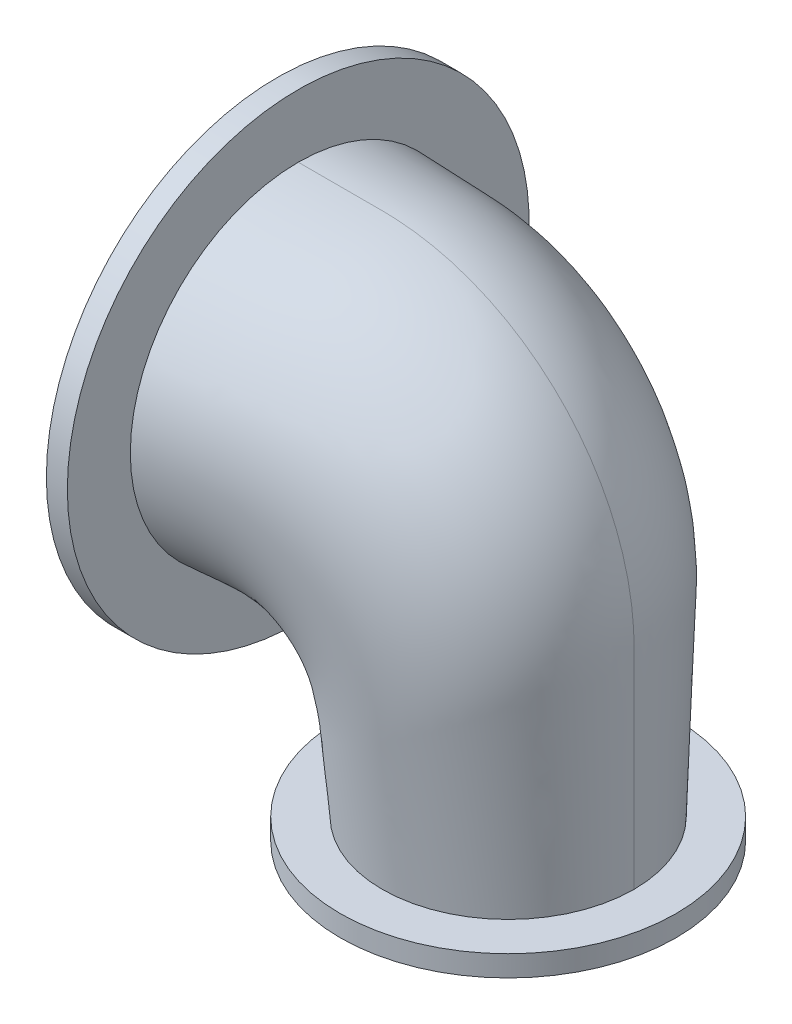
ISO-10303-21;
HEADER;
FILE_DESCRIPTION(('STEP AP214'),'2;1');
FILE_NAME('part.step','',(''),(''),'','','');
FILE_SCHEMA(('AUTOMOTIVE_DESIGN { 1 0 10303 214 1 1 1 1 }'));
ENDSEC;
DATA;
#1=APPLICATION_CONTEXT('core data for automotive mechanical design processes');
#2=APPLICATION_PROTOCOL_DEFINITION('international standard','automotive_design',2000,#1);
#3=PRODUCT_CONTEXT('',#1,'mechanical');
#4=PRODUCT('Part','Part','',(#3));
#5=PRODUCT_RELATED_PRODUCT_CATEGORY('part','',(#4));
#6=PRODUCT_DEFINITION_FORMATION('','',#4);
#7=PRODUCT_DEFINITION_CONTEXT('part definition',#1,'design');
#8=PRODUCT_DEFINITION('design','',#6,#7);
#9=PRODUCT_DEFINITION_SHAPE('','',#8);
#10=(LENGTH_UNIT() NAMED_UNIT(*) SI_UNIT(.MILLI.,.METRE.));
#11=(NAMED_UNIT(*) PLANE_ANGLE_UNIT() SI_UNIT($,.RADIAN.));
#12=(NAMED_UNIT(*) SI_UNIT($,.STERADIAN.) SOLID_ANGLE_UNIT());
#13=UNCERTAINTY_MEASURE_WITH_UNIT(LENGTH_MEASURE(1.E-05),#10,'distance_accuracy_value','');
#14=(GEOMETRIC_REPRESENTATION_CONTEXT(3) GLOBAL_UNCERTAINTY_ASSIGNED_CONTEXT((#13)) GLOBAL_UNIT_ASSIGNED_CONTEXT((#10,
#11,#12)) REPRESENTATION_CONTEXT('',''));
#15=CARTESIAN_POINT('',(0.,0.,0.));
#16=DIRECTION('',(0.,0.,1.));
#17=DIRECTION('',(1.,0.,0.));
#18=AXIS2_PLACEMENT_3D('',#15,#16,#17);
#19=CARTESIAN_POINT('',(19.05,0.,0.));
#20=DIRECTION('',(-1.,0.,0.));
#21=DIRECTION('',(0.,0.,1.));
#22=AXIS2_PLACEMENT_3D('',#19,#20,#21);
#23=PLANE('',#22);
#24=CARTESIAN_POINT('',(19.05,0.,0.));
#25=DIRECTION('',(-1.,0.,0.));
#26=DIRECTION('',(0.,0.,1.));
#27=AXIS2_PLACEMENT_3D('',#24,#25,#26);
#28=CIRCLE('',#27,10.795);
#29=CARTESIAN_POINT('',(19.05,0.,10.795));
#30=VERTEX_POINT('',#29);
#31=EDGE_CURVE('E4209',#30,#30,#28,.F.);
#32=ORIENTED_EDGE('',*,*,#31,.F.);
#33=EDGE_LOOP('',(#32));
#34=FACE_BOUND('',#33,.T.);
#35=CARTESIAN_POINT('',(19.05,-44.4499999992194,0.));
#36=CARTESIAN_POINT('',(19.05,-44.4500246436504,0.832851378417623));
#37=CARTESIAN_POINT('',(19.05,-44.4265935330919,1.6657009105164));
#38=CARTESIAN_POINT('',(19.05,-44.3329975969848,3.32874539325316));
#39=CARTESIAN_POINT('',(19.05,-44.2628341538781,4.15894042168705));
#40=CARTESIAN_POINT('',(19.05,-44.0759523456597,5.81406558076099));
#41=CARTESIAN_POINT('',(19.05,-43.9592344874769,6.63899576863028));
#42=CARTESIAN_POINT('',(19.05,-43.6796949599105,8.28041274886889));
#43=CARTESIAN_POINT('',(19.05,-43.5169056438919,9.09690505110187));
#44=CARTESIAN_POINT('',(19.05,-43.1456784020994,10.7194329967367));
#45=CARTESIAN_POINT('',(19.05,-42.9372411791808,11.5254688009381));
#46=CARTESIAN_POINT('',(19.05,-42.4753532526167,13.1245318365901));
#47=CARTESIAN_POINT('',(19.0499999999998,-42.2219029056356,13.9175591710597));
#48=CARTESIAN_POINT('',(19.0499999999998,-41.6707202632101,15.4882349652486));
#49=CARTESIAN_POINT('',(19.05,-41.3729799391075,16.2658806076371));
#50=CARTESIAN_POINT('',(19.05,-40.7341793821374,17.8031844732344));
#51=CARTESIAN_POINT('',(19.05,-40.3931184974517,18.5628424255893));
#52=CARTESIAN_POINT('',(19.05,-39.6687595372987,20.0617476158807));
#53=CARTESIAN_POINT('',(19.05,-39.2854614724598,20.8009948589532));
#54=CARTESIAN_POINT('',(19.05,-38.4779454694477,22.256569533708));
#55=CARTESIAN_POINT('',(19.05,-38.0537367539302,22.9729020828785));
#56=CARTESIAN_POINT('',(19.05,-37.1656754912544,24.3805703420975));
#57=CARTESIAN_POINT('',(19.05,-36.7018230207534,25.0719061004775));
#58=CARTESIAN_POINT('',(19.05,-35.7360105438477,26.4273567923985));
#59=CARTESIAN_POINT('',(19.0499999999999,-35.2340507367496,27.0914718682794));
#60=CARTESIAN_POINT('',(19.0499999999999,-33.9346304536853,28.7137119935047));
#61=CARTESIAN_POINT('',(19.05,-33.1143924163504,29.6537418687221));
#62=CARTESIAN_POINT('',(19.05,-31.397893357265,31.4614555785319));
#63=CARTESIAN_POINT('',(19.05,-30.5016322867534,32.329139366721));
#64=CARTESIAN_POINT('',(19.05,-28.6392396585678,33.986370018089));
#65=CARTESIAN_POINT('',(19.0500000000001,-27.6730953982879,34.775902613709));
#66=CARTESIAN_POINT('',(19.0499999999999,-25.6779725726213,36.2711119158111));
#67=CARTESIAN_POINT('',(19.0499999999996,-24.6489938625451,36.976788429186));
#68=CARTESIAN_POINT('',(19.0499999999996,-22.5322583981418,38.3013816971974));
#69=CARTESIAN_POINT('',(19.0499999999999,-21.4443321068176,38.9200275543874));
#70=CARTESIAN_POINT('',(19.0500000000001,-19.2203087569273,40.0636404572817));
#71=CARTESIAN_POINT('',(19.05,-18.0842116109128,40.5886073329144));
#72=CARTESIAN_POINT('',(19.05,-15.7719711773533,41.5411158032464));
#73=CARTESIAN_POINT('',(19.05,-14.595830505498,41.968663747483));
#74=CARTESIAN_POINT('',(19.05,-12.2117587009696,42.7233323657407));
#75=CARTESIAN_POINT('',(19.0499999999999,-11.0038275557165,43.0504530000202));
#76=CARTESIAN_POINT('',(19.0499999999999,-8.56259106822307,43.6023983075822));
#77=CARTESIAN_POINT('',(19.05,-7.32924503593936,43.827043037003));
#78=CARTESIAN_POINT('',(19.05,-4.84800184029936,44.1715505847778));
#79=CARTESIAN_POINT('',(19.05,-3.60010465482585,44.2914132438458));
#80=CARTESIAN_POINT('',(19.05,-1.09861815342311,44.425453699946));
#81=CARTESIAN_POINT('',(19.05,0.154971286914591,44.439629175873));
#82=CARTESIAN_POINT('',(19.05,2.65887443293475,44.3621363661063));
#83=CARTESIAN_POINT('',(19.0500000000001,3.90918814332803,44.2704682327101));
#84=CARTESIAN_POINT('',(19.0500000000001,6.39608537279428,43.982071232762));
#85=CARTESIAN_POINT('',(19.05,7.63268384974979,43.7854713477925));
#86=CARTESIAN_POINT('',(19.05,10.084887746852,43.2886498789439));
#87=CARTESIAN_POINT('',(19.05,11.3004931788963,42.9884283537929));
#88=CARTESIAN_POINT('',(19.05,13.7020189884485,42.2864732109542));
#89=CARTESIAN_POINT('',(19.05,14.8879396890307,41.8847406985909));
#90=CARTESIAN_POINT('',(19.05,17.2216366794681,40.9826020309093));
#91=CARTESIAN_POINT('',(19.05,18.3694130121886,40.4821959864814));
#92=CARTESIAN_POINT('',(19.05,20.6167673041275,39.3871676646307));
#93=CARTESIAN_POINT('',(19.05,21.7164214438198,38.7927017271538));
#94=CARTESIAN_POINT('',(19.05,23.8617028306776,37.5131852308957));
#95=CARTESIAN_POINT('',(19.05,24.9073301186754,36.8281347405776));
#96=CARTESIAN_POINT('',(19.05,26.9370566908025,35.3723649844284));
#97=CARTESIAN_POINT('',(19.0500000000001,27.9211591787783,34.6016501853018));
#98=CARTESIAN_POINT('',(19.0499999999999,29.8208991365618,32.9800001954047));
#99=CARTESIAN_POINT('',(19.0499999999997,30.7365367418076,32.1290651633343));
#100=CARTESIAN_POINT('',(19.0499999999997,32.4921228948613,30.3537783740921));
#101=CARTESIAN_POINT('',(19.0499999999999,33.3321298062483,29.4294842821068));
#102=CARTESIAN_POINT('',(19.0500000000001,34.9314189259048,27.5132895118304));
#103=CARTESIAN_POINT('',(19.05,35.6907005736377,26.5213883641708));
#104=CARTESIAN_POINT('',(19.05,36.7649261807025,24.988340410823));
#105=CARTESIAN_POINT('',(19.05,37.1123108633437,24.4696331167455));
#106=CARTESIAN_POINT('',(19.05,37.7849124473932,23.4180424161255));
#107=CARTESIAN_POINT('',(19.05,38.110130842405,22.8851599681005));
#108=CARTESIAN_POINT('',(19.05,38.7377793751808,21.8062302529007));
#109=CARTESIAN_POINT('',(19.05,39.0402123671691,21.2601846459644));
#110=CARTESIAN_POINT('',(19.05,39.6218673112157,20.155727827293));
#111=CARTESIAN_POINT('',(19.05,39.9010832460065,19.5973134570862));
#112=CARTESIAN_POINT('',(19.05,40.7034780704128,17.904239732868));
#113=CARTESIAN_POINT('',(19.05,41.1910018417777,16.7524411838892));
#114=CARTESIAN_POINT('',(19.05,42.0672207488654,14.4118614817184));
#115=CARTESIAN_POINT('',(19.05,42.4559170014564,13.2230807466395));
#116=CARTESIAN_POINT('',(19.05,42.9625691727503,11.4195204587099));
#117=CARTESIAN_POINT('',(19.05,43.1186651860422,10.81522722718));
#118=CARTESIAN_POINT('',(19.05,43.4052531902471,9.60069704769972));
#119=CARTESIAN_POINT('',(19.05,43.5357507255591,8.99046141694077));
#120=CARTESIAN_POINT('',(19.05,43.7708953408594,7.76526387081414));
#121=CARTESIAN_POINT('',(19.05,43.8755513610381,7.1503036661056));
#122=CARTESIAN_POINT('',(19.05,44.0588869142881,5.9165491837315));
#123=CARTESIAN_POINT('',(19.0500000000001,44.1375682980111,5.29775518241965));
#124=CARTESIAN_POINT('',(19.05,44.24432971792,4.28888493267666));
#125=CARTESIAN_POINT('',(19.05,44.2803358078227,3.89962900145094));
#126=CARTESIAN_POINT('',(19.05,44.3420616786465,3.12037844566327));
#127=CARTESIAN_POINT('',(19.05,44.3677836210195,2.73038399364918));
#128=CARTESIAN_POINT('',(19.05,44.4088985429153,1.95049978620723));
#129=CARTESIAN_POINT('',(19.05,44.4243085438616,1.56061092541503));
#130=CARTESIAN_POINT('',(19.05,44.4448609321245,0.780481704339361));
#131=CARTESIAN_POINT('',(19.05,44.4500011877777,0.390241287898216));
#132=CARTESIAN_POINT('',(19.05,44.45,0.));
#133=B_SPLINE_CURVE_WITH_KNOTS('',3,(#35,#36,#37,#38,#39,#40,#41,#42,#43,#44,#45,#46,#47,#48,
#49,#50,#51,#52,#53,#54,#55,#56,#57,#58,#59,#60,#61,#62,#63,#64,#65,#66,#67,#68,#69,#70,#71,#72,
#73,#74,#75,#76,#77,#78,#79,#80,#81,#82,#83,#84,#85,#86,#87,#88,#89,#90,#91,#92,#93,#94,#95,#96,
#97,#98,#99,#100,#101,#102,#103,#104,#105,#106,#107,#108,#109,#110,#111,#112,#113,#114,#115,
#116,#117,#118,#119,#120,#121,#122,#123,#124,#125,#126,#127,#128,#129,#130,#131,#132),
.UNSPECIFIED.,.F.,.F.,(4,2,2,2,2,2,2,2,2,2,2,2,2,2,2,2,2,2,2,2,2,2,2,2,2,2,2,2,2,2,2,2,2,2,2,2,
2,2,2,2,2,2,2,2,2,2,2,2,4),(0.,2.49822209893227,4.99637029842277,7.49449129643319,
9.99086234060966,12.4871949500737,14.9835077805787,17.4802736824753,19.9770771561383,
22.4738800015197,24.9701212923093,27.4663577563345,29.9625811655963,33.7006247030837,
37.4386706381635,41.1773977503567,44.9161334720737,48.6662606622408,52.4163946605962,
56.1662841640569,59.9161751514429,63.6726256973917,67.4290819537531,71.1856207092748,
74.9421540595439,78.6940804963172,82.4460048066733,86.1978882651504,89.9497675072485,
93.695474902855,97.441179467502,101.186688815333,104.932190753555,108.674777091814,
112.41738941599,114.289793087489,116.162070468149,118.034112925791,119.906639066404,
123.654083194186,127.401484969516,129.273409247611,131.14492763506,133.015797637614,
134.886534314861,136.059166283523,137.231551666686,138.401997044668,139.572685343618),.UNSPECIFIED.);
#134=CARTESIAN_POINT('',(19.0500000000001,-44.4499999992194,0.));
#135=VERTEX_POINT('',#134);
#136=CARTESIAN_POINT('',(19.05,44.45,0.));
#137=VERTEX_POINT('',#136);
#138=EDGE_CURVE('E4095',#135,#137,#133,.T.);
#139=ORIENTED_EDGE('',*,*,#138,.F.);
#140=CARTESIAN_POINT('',(19.05,44.45,0.));
#141=CARTESIAN_POINT('',(19.05,44.4500264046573,-0.833276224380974));
#142=CARTESIAN_POINT('',(19.05,44.4265696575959,-1.66654988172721));
#143=CARTESIAN_POINT('',(19.05,44.3328816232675,-3.33042595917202));
#144=CARTESIAN_POINT('',(19.05,44.2626524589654,-4.16102849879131));
#145=CARTESIAN_POINT('',(19.05,44.0756128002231,-5.81695925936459));
#146=CARTESIAN_POINT('',(19.05,43.9588030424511,-6.64228756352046));
#147=CARTESIAN_POINT('',(19.05,43.6790716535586,-8.28452182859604));
#148=CARTESIAN_POINT('',(19.05,43.5161810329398,-9.10143307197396));
#149=CARTESIAN_POINT('',(19.05,43.1447672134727,-10.7248060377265));
#150=CARTESIAN_POINT('',(19.05,42.9362445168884,-11.5312678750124));
#151=CARTESIAN_POINT('',(19.05,42.4742224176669,-13.1311983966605));
#152=CARTESIAN_POINT('',(19.05,42.2207232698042,-13.9246671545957));
#153=CARTESIAN_POINT('',(19.05,41.6694130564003,-15.4964812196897));
#154=CARTESIAN_POINT('',(19.05,41.3715810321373,-16.2748191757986));
#155=CARTESIAN_POINT('',(19.05,40.73262728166,-17.813530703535));
#156=CARTESIAN_POINT('',(19.05,40.3915049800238,-18.5739040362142));
#157=CARTESIAN_POINT('',(19.05,39.6670470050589,-20.0742693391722));
#158=CARTESIAN_POINT('',(19.05,39.2837113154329,-20.8142613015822));
#159=CARTESIAN_POINT('',(19.05,38.4761214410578,-22.2713656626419));
#160=CARTESIAN_POINT('',(19.05,38.0518757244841,-22.9884827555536));
#161=CARTESIAN_POINT('',(19.05,37.1637255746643,-24.3977366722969));
#162=CARTESIAN_POINT('',(19.05,36.6998212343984,-25.0898735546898));
#163=CARTESIAN_POINT('',(19.05,35.7338636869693,-26.4469264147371));
#164=CARTESIAN_POINT('',(19.05,35.2318106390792,-27.1118425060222));
#165=CARTESIAN_POINT('',(19.0499999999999,33.9312247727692,-28.7371118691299));
#166=CARTESIAN_POINT('',(19.05,33.1097821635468,-29.6792841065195));
#167=CARTESIAN_POINT('',(19.05,31.3904848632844,-31.490959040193));
#168=CARTESIAN_POINT('',(19.05,30.4926300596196,-32.3604616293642));
#169=CARTESIAN_POINT('',(19.05,28.6266691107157,-34.0208431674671));
#170=CARTESIAN_POINT('',(19.05,27.658552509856,-34.8117103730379));
#171=CARTESIAN_POINT('',(19.05,25.6590984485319,-36.3090066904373));
#172=CARTESIAN_POINT('',(19.0499999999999,24.6277610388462,-37.0154358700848));
#173=CARTESIAN_POINT('',(19.0499999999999,22.5098506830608,-38.3384322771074));
#174=CARTESIAN_POINT('',(19.05,21.4233118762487,-38.9550541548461));
#175=CARTESIAN_POINT('',(19.05,19.2021512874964,-40.0945712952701));
#176=CARTESIAN_POINT('',(19.05,18.0675295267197,-40.6174665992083));
#177=CARTESIAN_POINT('',(19.05,15.7583513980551,-41.5657990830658));
#178=CARTESIAN_POINT('',(19.05,14.5837976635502,-41.9912426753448));
#179=CARTESIAN_POINT('',(19.05,12.203038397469,-42.7417177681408));
#180=CARTESIAN_POINT('',(19.0499999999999,10.9968328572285,-43.0667492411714));
#181=CARTESIAN_POINT('',(19.0499999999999,8.56108162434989,-43.6141842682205));
#182=CARTESIAN_POINT('',(19.05,7.33153096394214,-43.8365657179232));
#183=CARTESIAN_POINT('',(19.05,4.85807748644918,-44.1770600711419));
#184=CARTESIAN_POINT('',(19.05,3.61417466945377,-44.2951729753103));
#185=CARTESIAN_POINT('',(19.05,1.12080956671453,-44.4263416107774));
#186=CARTESIAN_POINT('',(19.05,-0.128652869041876,-44.4393944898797));
#187=CARTESIAN_POINT('',(19.05,-2.62425004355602,-44.3603938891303));
#188=CARTESIAN_POINT('',(19.0499999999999,-3.87038477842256,-44.2683402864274));
#189=CARTESIAN_POINT('',(19.0499999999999,-6.35217635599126,-43.9796342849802));
#190=CARTESIAN_POINT('',(19.05,-7.58781685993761,-43.7828414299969));
#191=CARTESIAN_POINT('',(19.05,-10.0381635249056,-43.2860113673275));
#192=CARTESIAN_POINT('',(19.05,-11.2528696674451,-42.9859740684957));
#193=CARTESIAN_POINT('',(19.05,-13.6527642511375,-42.2848128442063));
#194=CARTESIAN_POINT('',(19.05,-14.8379523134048,-41.8836876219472));
#195=CARTESIAN_POINT('',(19.05,-17.1704088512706,-40.9832146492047));
#196=CARTESIAN_POINT('',(19.05,-18.3176772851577,-40.4838667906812));
#197=CARTESIAN_POINT('',(19.05,-20.5681067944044,-39.3895453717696));
#198=CARTESIAN_POINT('',(19.05,-21.6711886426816,-38.7944088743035));
#199=CARTESIAN_POINT('',(19.05,-23.823304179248,-37.5133334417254));
#200=CARTESIAN_POINT('',(19.05,-24.8723377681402,-36.827394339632));
#201=CARTESIAN_POINT('',(19.05,-26.9088195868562,-35.3695852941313));
#202=CARTESIAN_POINT('',(19.0500000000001,-27.896270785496,-34.5977194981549));
#203=CARTESIAN_POINT('',(19.0499999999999,-29.8025635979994,-32.9734663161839));
#204=CARTESIAN_POINT('',(19.0499999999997,-30.7214054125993,-32.121079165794));
#205=CARTESIAN_POINT('',(19.0499999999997,-32.4834068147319,-30.3422484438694));
#206=CARTESIAN_POINT('',(19.0499999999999,-33.3266053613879,-29.4158434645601));
#207=CARTESIAN_POINT('',(19.0500000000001,-34.9317623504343,-27.4951245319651));
#208=CARTESIAN_POINT('',(19.05,-35.69372020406,-26.500810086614));
#209=CARTESIAN_POINT('',(19.05,-37.1310727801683,-24.451021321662));
#210=CARTESIAN_POINT('',(19.05,-37.806441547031,-23.3955288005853));
#211=CARTESIAN_POINT('',(19.05,-39.0654228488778,-21.2312137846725));
#212=CARTESIAN_POINT('',(19.0499999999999,-39.6490384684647,-20.122393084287));
#213=CARTESIAN_POINT('',(19.0499999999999,-40.7188278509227,-17.8625014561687));
#214=CARTESIAN_POINT('',(19.05,-41.205269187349,-16.7115571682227));
#215=CARTESIAN_POINT('',(19.05,-42.0793488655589,-14.3725634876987));
#216=CARTESIAN_POINT('',(19.05,-42.4669749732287,-13.1845095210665));
#217=CARTESIAN_POINT('',(19.05,-43.1401916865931,-10.7816112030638));
#218=CARTESIAN_POINT('',(19.0500000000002,-43.425917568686,-9.56680466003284));
#219=CARTESIAN_POINT('',(19.0499999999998,-43.8940240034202,-7.11782385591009));
#220=CARTESIAN_POINT('',(19.0499999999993,-44.0764550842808,-5.88365936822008));
#221=CARTESIAN_POINT('',(19.0499999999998,-44.2472377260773,-4.25843989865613));
#222=CARTESIAN_POINT('',(19.0499999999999,-44.2827346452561,-3.87194042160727));
#223=CARTESIAN_POINT('',(19.0500000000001,-44.3435888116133,-3.09820314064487));
#224=CARTESIAN_POINT('',(19.05,-44.3689481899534,-2.71096550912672));
#225=CARTESIAN_POINT('',(19.05,-44.4094819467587,-1.93661224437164));
#226=CARTESIAN_POINT('',(19.05,-44.424673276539,-1.54949748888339));
#227=CARTESIAN_POINT('',(19.05,-44.4449337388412,-0.774922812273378));
#228=CARTESIAN_POINT('',(19.05,-44.4500007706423,-0.387462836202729));
#229=CARTESIAN_POINT('',(19.0499999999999,-44.4499999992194,0.));
#230=B_SPLINE_CURVE_WITH_KNOTS('',3,(#140,#141,#142,#143,#144,#145,#146,#147,#148,#149,#150,
#151,#152,#153,#154,#155,#156,#157,#158,#159,#160,#161,#162,#163,#164,#165,#166,#167,#168,#169,
#170,#171,#172,#173,#174,#175,#176,#177,#178,#179,#180,#181,#182,#183,#184,#185,#186,#187,#188,
#189,#190,#191,#192,#193,#194,#195,#196,#197,#198,#199,#200,#201,#202,#203,#204,#205,#206,#207,
#208,#209,#210,#211,#212,#213,#214,#215,#216,#217,#218,#219,#220,#221,#222,#223,#224,#225,#226,
#227,#228,#229),.UNSPECIFIED.,.F.,.F.,(4,2,2,2,2,2,2,2,2,2,2,2,2,2,2,2,2,2,2,2,2,2,2,2,2,2,2,2,
2,2,2,2,2,2,2,2,2,2,2,2,2,2,2,2,4),(0.,2.49949492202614,4.9988764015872,7.49821835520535,
9.99588234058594,12.4935188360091,14.9911411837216,17.4899480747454,19.9887881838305,
22.4876292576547,24.9859541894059,27.4842732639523,29.9825819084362,33.7278139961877,
37.4730516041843,41.2188476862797,44.9646407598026,48.7081447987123,52.4516471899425,
56.1949031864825,59.9381602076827,63.6822229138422,67.4262855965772,71.1704499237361,
74.9146186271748,78.6638209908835,82.4130266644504,86.162280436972,89.9115383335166,
93.6672424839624,97.4229535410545,101.178483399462,104.934002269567,108.687575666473,
112.441176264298,116.195899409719,119.950496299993,123.694607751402,127.439182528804,
131.178767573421,134.91652175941,136.08082070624,137.244874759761,138.40698333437,
139.569333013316),.UNSPECIFIED.);
#231=EDGE_CURVE('E4054',#137,#135,#230,.T.);
#232=ORIENTED_EDGE('',*,*,#231,.F.);
#233=EDGE_LOOP('',(#139,#232));
#234=FACE_BOUND('',#233,.T.);
#235=ADVANCED_FACE('F4032',(#34,#234),#23,.F.);
#236=CARTESIAN_POINT('',(44.4499988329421,-89.6472909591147,0.));
#237=CARTESIAN_POINT('',(44.4499992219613,-89.3981939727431,0.));
#238=CARTESIAN_POINT('',(44.4499996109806,-89.1490969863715,0.));
#239=CARTESIAN_POINT('',(44.4500031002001,-86.914878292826,0.));
#240=CARTESIAN_POINT('',(44.4500093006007,-82.9446348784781,0.));
#241=CARTESIAN_POINT('',(44.4499627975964,-76.9892482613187,0.));
#242=CARTESIAN_POINT('',(44.4500806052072,-73.0190478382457,0.));
#243=CARTESIAN_POINT('',(44.4499230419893,-69.1385635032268,0.));
#244=CARTESIAN_POINT('',(44.4496751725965,-66.8370314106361,0.));
#245=CARTESIAN_POINT('',(44.4502527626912,-63.994302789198,0.));
#246=CARTESIAN_POINT('',(44.4481850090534,-62.0982055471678,0.));
#247=CARTESIAN_POINT('',(43.8191092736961,-58.8815825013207,0.));
#248=CARTESIAN_POINT('',(41.6279157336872,-54.95148933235,0.));
#249=CARTESIAN_POINT('',(37.8902267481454,-52.0972766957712,0.));
#250=CARTESIAN_POINT('',(34.44610890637,-50.9784164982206,0.));
#251=CARTESIAN_POINT('',(32.3115447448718,-50.7883803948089,0.));
#252=CARTESIAN_POINT('',(30.8866055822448,-50.8029758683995,0.));
#253=CARTESIAN_POINT('',(28.9926839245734,-50.7971644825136,0.));
#254=CARTESIAN_POINT('',(27.3811200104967,-50.7995170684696,0.));
#255=CARTESIAN_POINT('',(25.402316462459,-50.800323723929,0.));
#256=CARTESIAN_POINT('',(23.8143304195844,-50.7998505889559,0.));
#257=CARTESIAN_POINT('',(21.4321386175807,-50.800037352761,0.));
#258=CARTESIAN_POINT('',(19.8440462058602,-50.8000124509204,0.));
#259=CARTESIAN_POINT('',(18.8529075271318,-50.7999969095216,0.));
#260=CARTESIAN_POINT('',(18.6558150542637,-50.7999938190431,0.));
#261=CARTESIAN_POINT('',(18.4587225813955,-50.7999907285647,0.));
#262=CARTESIAN_POINT('',(44.4499988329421,-89.6472909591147,75.8764573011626));
#263=CARTESIAN_POINT('',(44.4499992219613,-89.3981939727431,75.9843048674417));
#264=CARTESIAN_POINT('',(44.4499996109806,-89.1490969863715,76.0921524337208));
#265=CARTESIAN_POINT('',(44.4500031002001,-86.914878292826,77.0594666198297));
#266=CARTESIAN_POINT('',(44.4500093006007,-82.9446348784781,78.8172971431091));
#267=CARTESIAN_POINT('',(44.4499627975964,-76.9892482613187,81.5449521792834));
#268=CARTESIAN_POINT('',(44.4500806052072,-73.0190478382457,83.4193680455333));
#269=CARTESIAN_POINT('',(44.4499230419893,-69.1385635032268,85.2913634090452));
#270=CARTESIAN_POINT('',(44.4496751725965,-66.8370314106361,86.3777180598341));
#271=CARTESIAN_POINT('',(44.4502527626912,-63.994302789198,87.6616127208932));
#272=CARTESIAN_POINT('',(44.4481850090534,-62.0982055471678,88.5009757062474));
#273=CARTESIAN_POINT('',(43.8191092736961,-58.8815825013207,89.9766954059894));
#274=CARTESIAN_POINT('',(41.6279157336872,-54.95148933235,91.9679799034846));
#275=CARTESIAN_POINT('',(37.8902267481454,-52.0972766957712,93.9576766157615));
#276=CARTESIAN_POINT('',(34.44610890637,-50.9784164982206,95.4373541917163));
#277=CARTESIAN_POINT('',(32.3115447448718,-50.7883803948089,96.284670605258));
#278=CARTESIAN_POINT('',(30.8866055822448,-50.8029758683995,96.8379048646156));
#279=CARTESIAN_POINT('',(28.9926839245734,-50.7971644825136,97.5758857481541));
#280=CARTESIAN_POINT('',(27.3811200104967,-50.7995170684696,98.20016332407));
#281=CARTESIAN_POINT('',(25.402316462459,-50.800323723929,98.9743693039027));
#282=CARTESIAN_POINT('',(23.8143304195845,-50.7998505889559,99.611036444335));
#283=CARTESIAN_POINT('',(21.4321386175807,-50.800037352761,100.590958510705));
#284=CARTESIAN_POINT('',(19.8440462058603,-50.8000124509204,101.260470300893));
#285=CARTESIAN_POINT('',(18.8529075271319,-50.7999969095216,101.684275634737));
#286=CARTESIAN_POINT('',(18.6558150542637,-50.7999938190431,101.768551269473));
#287=CARTESIAN_POINT('',(18.4587225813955,-50.7999907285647,101.85282690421));
#288=CARTESIAN_POINT('',(120.65,-91.5560350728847,75.8764573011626));
#289=CARTESIAN_POINT('',(120.65,-90.6706900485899,75.9843048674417));
#290=CARTESIAN_POINT('',(120.65,-89.7853450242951,76.0921524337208));
#291=CARTESIAN_POINT('',(120.65,-81.8444444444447,77.0594666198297));
#292=CARTESIAN_POINT('',(120.65,-67.7333333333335,78.8172971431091));
#293=CARTESIAN_POINT('',(120.65,-46.5666666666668,81.5449521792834));
#294=CARTESIAN_POINT('',(120.65,-32.4555555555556,83.4193680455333));
#295=CARTESIAN_POINT('',(120.65,-18.6636918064,85.2913634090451));
#296=CARTESIAN_POINT('',(119.563745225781,-10.5923261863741,86.3777180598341));
#297=CARTESIAN_POINT('',(116.725385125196,-1.08594619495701,87.6616127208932));
#298=CARTESIAN_POINT('',(114.426942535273,5.10970816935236,88.5009757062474));
#299=CARTESIAN_POINT('',(109.199959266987,15.7207560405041,89.9766954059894));
#300=CARTESIAN_POINT('',(98.9623227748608,29.112322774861,91.9679799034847));
#301=CARTESIAN_POINT('',(84.9011777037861,39.8618410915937,93.9576766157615));
#302=CARTESIAN_POINT('',(72.9192107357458,45.5214050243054,95.4373541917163));
#303=CARTESIAN_POINT('',(65.6780816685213,47.849333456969,96.284670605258));
#304=CARTESIAN_POINT('',(60.8552721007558,49.0440361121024,96.8379048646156));
#305=CARTESIAN_POINT('',(54.3386133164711,50.3247635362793,97.5758857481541));
#306=CARTESIAN_POINT('',(48.6601926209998,50.8,98.20016332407));
#307=CARTESIAN_POINT('',(41.6277777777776,50.8,98.9743693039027));
#308=CARTESIAN_POINT('',(35.9833333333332,50.8,99.611036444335));
#309=CARTESIAN_POINT('',(27.5166666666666,50.8,100.590958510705));
#310=CARTESIAN_POINT('',(21.8722222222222,50.8,101.260470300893));
#311=CARTESIAN_POINT('',(18.3494881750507,50.8,101.684275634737));
#312=CARTESIAN_POINT('',(17.6489763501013,50.8,101.768551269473));
#313=CARTESIAN_POINT('',(16.948464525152,50.8,101.85282690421));
#314=CARTESIAN_POINT('',(120.65,-91.5560350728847,0.));
#315=CARTESIAN_POINT('',(120.65,-90.6706900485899,0.));
#316=CARTESIAN_POINT('',(120.65,-89.7853450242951,0.));
#317=CARTESIAN_POINT('',(120.65,-81.8444444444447,0.));
#318=CARTESIAN_POINT('',(120.65,-67.7333333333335,0.));
#319=CARTESIAN_POINT('',(120.65,-46.5666666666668,0.));
#320=CARTESIAN_POINT('',(120.65,-32.4555555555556,0.));
#321=CARTESIAN_POINT('',(120.65,-18.6636918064,0.));
#322=CARTESIAN_POINT('',(119.563745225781,-10.5923261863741,0.));
#323=CARTESIAN_POINT('',(116.725385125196,-1.08594619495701,0.));
#324=CARTESIAN_POINT('',(114.426942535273,5.10970816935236,0.));
#325=CARTESIAN_POINT('',(109.199959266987,15.7207560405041,0.));
#326=CARTESIAN_POINT('',(98.9623227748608,29.112322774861,0.));
#327=CARTESIAN_POINT('',(84.9011777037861,39.8618410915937,0.));
#328=CARTESIAN_POINT('',(72.9192107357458,45.5214050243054,0.));
#329=CARTESIAN_POINT('',(65.6780816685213,47.849333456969,0.));
#330=CARTESIAN_POINT('',(60.8552721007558,49.0440361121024,0.));
#331=CARTESIAN_POINT('',(54.3386133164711,50.3247635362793,0.));
#332=CARTESIAN_POINT('',(48.6601926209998,50.8,0.));
#333=CARTESIAN_POINT('',(41.6277777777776,50.8,0.));
#334=CARTESIAN_POINT('',(35.9833333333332,50.8,0.));
#335=CARTESIAN_POINT('',(27.5166666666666,50.8,0.));
#336=CARTESIAN_POINT('',(21.8722222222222,50.8,0.));
#337=CARTESIAN_POINT('',(18.3494881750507,50.8,0.));
#338=CARTESIAN_POINT('',(17.6489763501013,50.8,0.));
#339=CARTESIAN_POINT('',(16.948464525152,50.8,0.));
#340=(BOUNDED_SURFACE() B_SPLINE_SURFACE(3,3,((#236,#237,#238,#239,#240,#241,#242,#243,#244,
#245,#246,#247,#248,#249,#250,#251,#252,#253,#254,#255,#256,#257,#258,#259,#260,#261),(#262,
#263,#264,#265,#266,#267,#268,#269,#270,#271,#272,#273,#274,#275,#276,#277,#278,#279,#280,#281,
#282,#283,#284,#285,#286,#287),(#288,#289,#290,#291,#292,#293,#294,#295,#296,#297,#298,#299,
#300,#301,#302,#303,#304,#305,#306,#307,#308,#309,#310,#311,#312,#313),(#314,#315,#316,#317,
#318,#319,#320,#321,#322,#323,#324,#325,#326,#327,#328,#329,#330,#331,#332,#333,#334,#335,#336,
#337,#338,#339)),.UNSPECIFIED.,.F.,.F.,.F.) B_SPLINE_SURFACE_WITH_KNOTS((4,4),(4,2,1,1,2,1,1,1,
1,1,1,1,1,1,1,2,1,1,2,4),(0.,1.),(-0.01263854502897,0.,0.100720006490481,0.201440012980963,
0.302160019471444,0.398322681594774,0.418928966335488,0.446404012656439,0.494485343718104,
0.590648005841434,0.686810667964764,0.746912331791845,0.782973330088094,0.797397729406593,
0.819034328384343,0.879135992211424,0.919423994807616,0.959711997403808,1.,1.01),
.UNSPECIFIED.) GEOMETRIC_REPRESENTATION_ITEM() RATIONAL_B_SPLINE_SURFACE(((1.,1.,1.,1.,1.,1.,1.,
1.,1.,1.,1.,1.,1.,1.,1.,1.,1.,1.,1.,1.,1.,1.,1.,1.,1.,1.),(0.333333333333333,0.333333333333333,
0.333333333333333,0.333333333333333,0.333333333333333,0.333333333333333,0.333333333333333,
0.333333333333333,0.333333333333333,0.333333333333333,0.333333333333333,0.333333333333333,
0.333333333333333,0.333333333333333,0.333333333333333,0.333333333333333,0.333333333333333,
0.333333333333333,0.333333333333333,0.333333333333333,0.333333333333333,0.333333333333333,
0.333333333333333,0.333333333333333,0.333333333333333,0.333333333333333),(0.333333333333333,
0.333333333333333,0.333333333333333,0.333333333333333,0.333333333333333,0.333333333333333,
0.333333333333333,0.333333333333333,0.333333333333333,0.333333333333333,0.333333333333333,
0.333333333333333,0.333333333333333,0.333333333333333,0.333333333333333,0.333333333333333,
0.333333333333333,0.333333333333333,0.333333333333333,0.333333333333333,0.333333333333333,
0.333333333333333,0.333333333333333,0.333333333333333,0.333333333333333,0.333333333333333),(1.,
1.,1.,1.,1.,1.,1.,1.,1.,1.,1.,1.,1.,1.,1.,1.,1.,1.,1.,1.,1.,1.,1.,1.,1.,1.))) REPRESENTATION_ITEM('') SURFACE());
#341=OFFSET_SURFACE('',#340,-6.35,.F.);
#342=CARTESIAN_POINT('',(114.3,-88.9000000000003,0.));
#343=CARTESIAN_POINT('',(114.300018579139,-88.9000000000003,0.595102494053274));
#344=CARTESIAN_POINT('',(114.283269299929,-88.9000000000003,1.190202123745));
#345=CARTESIAN_POINT('',(114.21637086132,-88.9000000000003,2.37849477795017));
#346=CARTESIAN_POINT('',(114.166223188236,-88.9000000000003,2.97168788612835));
#347=CARTESIAN_POINT('',(114.032664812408,-88.9000000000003,4.15431074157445));
#348=CARTESIAN_POINT('',(113.949254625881,-88.9000000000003,4.74374054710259));
#349=CARTESIAN_POINT('',(113.749507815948,-88.9000000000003,5.91658496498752));
#350=CARTESIAN_POINT('',(113.633192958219,-88.9000000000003,6.50000329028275));
#351=CARTESIAN_POINT('',(113.367965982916,-88.9000000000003,7.6594101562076));
#352=CARTESIAN_POINT('',(113.219054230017,-88.9000000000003,8.2353987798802));
#353=CARTESIAN_POINT('',(112.971624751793,-88.9000000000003,9.09233245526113));
#354=CARTESIAN_POINT('',(112.885138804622,-88.9000000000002,9.37679970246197));
#355=CARTESIAN_POINT('',(112.704192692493,-88.9000000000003,9.94324783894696));
#356=CARTESIAN_POINT('',(112.60973077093,-88.9000000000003,10.2252281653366));
#357=CARTESIAN_POINT('',(112.216040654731,-88.9000000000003,11.3477690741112));
#358=CARTESIAN_POINT('',(111.885152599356,-88.9000000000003,12.1774866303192));
#359=CARTESIAN_POINT('',(111.154570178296,-88.9000000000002,13.8061443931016));
#360=CARTESIAN_POINT('',(110.754866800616,-88.9000000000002,14.6050805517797));
#361=CARTESIAN_POINT('',(110.106011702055,-88.9000000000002,15.7758647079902));
#362=CARTESIAN_POINT('',(109.881498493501,-88.9000000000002,16.1615399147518));
#363=CARTESIAN_POINT('',(109.416454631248,-88.9000000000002,16.9229897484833));
#364=CARTESIAN_POINT('',(109.175928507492,-88.9000000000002,17.2987671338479));
#365=CARTESIAN_POINT('',(108.679210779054,-88.9000000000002,18.0398767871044));
#366=CARTESIAN_POINT('',(108.4230176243,-88.9000000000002,18.4052080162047));
#367=CARTESIAN_POINT('',(107.895445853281,-88.9000000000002,19.1247413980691));
#368=CARTESIAN_POINT('',(107.624066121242,-88.9000000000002,19.478942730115));
#369=CARTESIAN_POINT('',(106.788203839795,-88.9000000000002,20.5234437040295));
#370=CARTESIAN_POINT('',(106.201588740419,-88.9000000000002,21.1962510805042));
#371=CARTESIAN_POINT('',(104.973807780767,-88.9000000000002,22.4899282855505));
#372=CARTESIAN_POINT('',(104.332641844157,-88.9000000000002,23.1107980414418));
#373=CARTESIAN_POINT('',(103.000127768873,-88.9000000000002,24.2963837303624));
#374=CARTESIAN_POINT('',(102.308772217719,-88.9000000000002,24.8610913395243));
#375=CARTESIAN_POINT('',(100.88090909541,-88.9000000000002,25.9301872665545));
#376=CARTESIAN_POINT('',(100.144401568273,-88.9000000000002,26.4345756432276));
#377=CARTESIAN_POINT('',(98.6321278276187,-88.9000000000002,27.3790431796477));
#378=CARTESIAN_POINT('',(97.8563959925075,-88.9000000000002,27.8191773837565));
#379=CARTESIAN_POINT('',(96.2706126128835,-88.9000000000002,28.6325302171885));
#380=CARTESIAN_POINT('',(95.4605610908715,-88.9000000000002,29.0057488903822));
#381=CARTESIAN_POINT('',(93.81195803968,-88.9000000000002,29.6826123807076));
#382=CARTESIAN_POINT('',(92.9734084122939,-88.9000000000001,29.9862618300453));
#383=CARTESIAN_POINT('',(91.2737231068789,-88.9000000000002,30.5218870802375));
#384=CARTESIAN_POINT('',(90.4125874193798,-88.9000000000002,30.7538628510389));
#385=CARTESIAN_POINT('',(88.6735940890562,-88.9000000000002,31.1445860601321));
#386=CARTESIAN_POINT('',(87.7957315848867,-88.9000000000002,31.3033118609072));
#387=CARTESIAN_POINT('',(86.029767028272,-88.9000000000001,31.5463503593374));
#388=CARTESIAN_POINT('',(85.1416649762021,-88.9000000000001,31.6306630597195));
#389=CARTESIAN_POINT('',(83.3614923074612,-88.9000000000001,31.724327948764));
#390=CARTESIAN_POINT('',(82.4694215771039,-88.9000000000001,31.7336779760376));
#391=CARTESIAN_POINT('',(80.6876489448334,-88.9000000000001,31.6773979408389));
#392=CARTESIAN_POINT('',(79.797947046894,-88.9000000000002,31.6117677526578));
#393=CARTESIAN_POINT('',(78.0254792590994,-88.9000000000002,31.4058431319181));
#394=CARTESIAN_POINT('',(77.1427301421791,-88.9000000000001,31.2654043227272));
#395=CARTESIAN_POINT('',(75.392163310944,-88.9000000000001,30.9108151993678));
#396=CARTESIAN_POINT('',(74.5243456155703,-88.9000000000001,30.6966647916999));
#397=CARTESIAN_POINT('',(72.8097557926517,-88.9000000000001,30.1962002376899));
#398=CARTESIAN_POINT('',(71.962984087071,-88.9000000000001,29.9098846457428));
#399=CARTESIAN_POINT('',(70.296482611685,-88.9,29.2671384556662));
#400=CARTESIAN_POINT('',(69.4767528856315,-88.9,28.9107077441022));
#401=CARTESIAN_POINT('',(67.8681366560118,-88.9,28.1292855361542));
#402=CARTESIAN_POINT('',(67.0793315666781,-88.9,27.7041264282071));
#403=CARTESIAN_POINT('',(65.5403318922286,-88.9,26.7888789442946));
#404=CARTESIAN_POINT('',(64.7901374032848,-88.9,26.2987904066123));
#405=CARTESIAN_POINT('',(63.3337578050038,-88.9,25.2571517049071));
#406=CARTESIAN_POINT('',(62.6275705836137,-88.9,24.7056044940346));
#407=CARTESIAN_POINT('',(61.2642473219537,-88.9000000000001,23.5448968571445));
#408=CARTESIAN_POINT('',(60.6071111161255,-88.9000000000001,22.9357366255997));
#409=CARTESIAN_POINT('',(59.3470720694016,-88.9000000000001,21.6645030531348));
#410=CARTESIAN_POINT('',(58.7441331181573,-88.9,21.0024655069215));
#411=CARTESIAN_POINT('',(57.596383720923,-88.9,19.6297746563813));
#412=CARTESIAN_POINT('',(57.0515736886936,-88.9,18.9191210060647));
#413=CARTESIAN_POINT('',(56.0239325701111,-88.9,17.454026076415));
#414=CARTESIAN_POINT('',(55.541119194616,-88.9,16.6995723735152));
#415=CARTESIAN_POINT('',(54.6412082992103,-88.9,15.1524724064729));
#416=CARTESIAN_POINT('',(54.2241084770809,-88.9,14.3598274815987));
#417=CARTESIAN_POINT('',(53.4602811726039,-88.9,12.7454945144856));
#418=CARTESIAN_POINT('',(53.1132594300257,-88.9,11.9239456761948));
#419=CARTESIAN_POINT('',(52.4897728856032,-88.9,10.2543757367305));
#420=CARTESIAN_POINT('',(52.2133167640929,-88.9,9.40635139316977));
#421=CARTESIAN_POINT('',(51.7332416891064,-88.9,7.69116809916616));
#422=CARTESIAN_POINT('',(51.5295268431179,-88.9,6.82403595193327));
#423=CARTESIAN_POINT('',(51.1958520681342,-88.9,5.07605007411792));
#424=CARTESIAN_POINT('',(51.0658561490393,-88.9,4.19520325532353));
#425=CARTESIAN_POINT('',(50.915384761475,-88.9,2.76035213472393));
#426=CARTESIAN_POINT('',(50.8720855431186,-88.9,2.20864088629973));
#427=CARTESIAN_POINT('',(50.814415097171,-88.9,1.10463876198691));
#428=CARTESIAN_POINT('',(50.7999953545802,-88.9,0.552350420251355));
#429=CARTESIAN_POINT('',(50.8000000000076,-88.9000000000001,0.));
#430=B_SPLINE_CURVE_WITH_KNOTS('',3,(#342,#343,#344,#345,#346,#347,#348,#349,#350,#351,#352,
#353,#354,#355,#356,#357,#358,#359,#360,#361,#362,#363,#364,#365,#366,#367,#368,#369,#370,#371,
#372,#373,#374,#375,#376,#377,#378,#379,#380,#381,#382,#383,#384,#385,#386,#387,#388,#389,#390,
#391,#392,#393,#394,#395,#396,#397,#398,#399,#400,#401,#402,#403,#404,#405,#406,#407,#408,#409,
#410,#411,#412,#413,#414,#415,#416,#417,#418,#419,#420,#421,#422,#423,#424,#425,#426,#427,#428,
#429),.UNSPECIFIED.,.F.,.F.,(4,2,2,2,2,2,2,2,2,2,2,2,2,2,2,2,2,2,2,2,2,2,2,2,2,2,2,2,2,2,2,2,2,
2,2,2,2,2,2,2,2,2,2,4),(0.,1.78506713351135,3.57005483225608,5.35501483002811,7.13879686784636,
8.92255895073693,9.814424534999,10.7064870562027,13.3828034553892,16.0594706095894,
17.3979277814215,18.7360079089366,20.07422063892,21.4125318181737,24.0869552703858,
26.7613824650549,29.4362054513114,32.1110258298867,34.7835411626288,37.4560547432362,
40.1283903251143,42.800727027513,45.4738526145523,48.1469781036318,50.8201806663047,
53.4933877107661,56.1717726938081,58.8501610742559,61.5286031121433,64.2070494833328,
66.892129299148,69.5772158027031,72.2621733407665,74.947121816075,77.6302679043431,
80.313433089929,82.9973630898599,85.6811990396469,88.3535197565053,91.026169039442,
93.6952819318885,96.3630906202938,98.022620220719,99.6793596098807),.UNSPECIFIED.);
#431=CARTESIAN_POINT('',(114.3,-88.900000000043,0.));
#432=VERTEX_POINT('',#431);
#433=CARTESIAN_POINT('',(50.7999999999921,-88.9000099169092,0.));
#434=VERTEX_POINT('',#433);
#435=EDGE_CURVE('E4080',#432,#434,#430,.T.);
#436=ORIENTED_EDGE('',*,*,#435,.T.);
#437=CARTESIAN_POINT('',(50.7999999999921,-88.9000099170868,-1.15648761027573E-09));
#438=CARTESIAN_POINT('',(50.7999789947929,-86.4363281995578,-1.71836658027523E-09));
#439=CARTESIAN_POINT('',(50.7999827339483,-83.9726464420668,-1.45766849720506E-09));
#440=CARTESIAN_POINT('',(50.8000063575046,-79.0453270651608,-7.59790650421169E-10));
#441=CARTESIAN_POINT('',(50.8000262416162,-76.5816894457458,-3.22614048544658E-10));
#442=CARTESIAN_POINT('',(50.8000431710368,-72.8860826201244,-6.35941125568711E-10));
#443=CARTESIAN_POINT('',(50.8000466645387,-71.6541133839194,-9.01944650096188E-10));
#444=CARTESIAN_POINT('',(50.7998963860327,-69.1904965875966,-1.17936001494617E-09));
#445=CARTESIAN_POINT('',(50.7997426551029,-67.9588490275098,-1.19083833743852E-09));
#446=CARTESIAN_POINT('',(50.7999372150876,-66.1114302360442,-5.51905172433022E-10));
#447=CARTESIAN_POINT('',(50.8000729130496,-65.495658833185,-2.29596578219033E-10));
#448=CARTESIAN_POINT('',(50.8000633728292,-64.7254341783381,-5.74259495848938E-10));
#449=CARTESIAN_POINT('',(50.8000524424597,-64.5709812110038,-6.80988683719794E-10));
#450=CARTESIAN_POINT('',(50.8000810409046,-64.2600987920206,-8.30682482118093E-10));
#451=CARTESIAN_POINT('',(50.8001212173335,-64.1036693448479,-8.72813490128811E-10));
#452=CARTESIAN_POINT('',(50.7996008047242,-63.7725109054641,-6.18203052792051E-10));
#453=CARTESIAN_POINT('',(50.7989693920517,-63.5977817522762,-2.8124588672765E-10));
#454=CARTESIAN_POINT('',(50.7948540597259,-63.2257804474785,-2.04246137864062E-10));
#455=CARTESIAN_POINT('',(50.7910122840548,-63.0285111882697,-5.46911999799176E-10));
#456=CARTESIAN_POINT('',(50.7776747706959,-62.6112475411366,-8.75030009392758E-10));
#457=CARTESIAN_POINT('',(50.7675751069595,-62.3912703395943,-8.1445633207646E-10));
#458=CARTESIAN_POINT('',(50.7384882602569,-61.9381524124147,-6.0960687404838E-10));
#459=CARTESIAN_POINT('',(50.7189874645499,-61.7050437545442,-4.60360339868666E-10));
#460=CARTESIAN_POINT('',(50.6711297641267,-61.2421926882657,-2.74984880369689E-10));
#461=CARTESIAN_POINT('',(50.6428671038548,-61.0124404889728,-2.37695297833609E-10));
#462=CARTESIAN_POINT('',(50.5779683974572,-60.5568393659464,-3.9474874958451E-10));
#463=CARTESIAN_POINT('',(50.5414331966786,-60.3309760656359,-5.86412136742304E-10));
#464=CARTESIAN_POINT('',(50.4604216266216,-59.8833992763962,-5.23990348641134E-10));
#465=CARTESIAN_POINT('',(50.4160428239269,-59.6616681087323,-2.75076814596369E-10));
#466=CARTESIAN_POINT('',(50.3197962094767,-59.2225562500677,-3.72823387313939E-10));
#467=CARTESIAN_POINT('',(50.2680220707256,-59.0051550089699,-7.12550975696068E-10));
#468=CARTESIAN_POINT('',(50.1574271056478,-58.5748654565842,-7.07700785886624E-10));
#469=CARTESIAN_POINT('',(50.0986958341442,-58.3619541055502,-3.71084612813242E-10));
#470=CARTESIAN_POINT('',(49.9745095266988,-57.9403222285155,-1.87065423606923E-11));
#471=CARTESIAN_POINT('',(49.9091244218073,-57.7315810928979,1.03341716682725E-13));
#472=CARTESIAN_POINT('',(49.7715117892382,-57.3171770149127,-1.5640944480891E-10));
#473=CARTESIAN_POINT('',(49.6993089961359,-57.1115058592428,-3.31053277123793E-10));
#474=CARTESIAN_POINT('',(49.5481560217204,-56.7033321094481,-3.66956312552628E-10));
#475=CARTESIAN_POINT('',(49.4692258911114,-56.5008220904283,-2.29117458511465E-10));
#476=CARTESIAN_POINT('',(49.3047431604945,-56.0991299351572,-2.02071962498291E-10));
#477=CARTESIAN_POINT('',(49.2192084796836,-55.8999404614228,-3.12213915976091E-10));
#478=CARTESIAN_POINT('',(49.0416385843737,-55.5050450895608,-2.22581959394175E-10));
#479=CARTESIAN_POINT('',(48.9496191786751,-55.3093320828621,-2.35384405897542E-11));
#480=CARTESIAN_POINT('',(48.7592017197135,-54.9215411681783,7.82480263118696E-12));
#481=CARTESIAN_POINT('',(48.6608173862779,-54.7294565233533,-1.59090619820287E-10));
#482=CARTESIAN_POINT('',(48.4577907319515,-54.349070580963,-4.40261607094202E-10));
#483=CARTESIAN_POINT('',(48.3531600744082,-54.1607630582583,-5.54612050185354E-10));
#484=CARTESIAN_POINT('',(48.1377602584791,-53.7880768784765,-4.62206726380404E-10));
#485=CARTESIAN_POINT('',(48.0270007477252,-53.6036926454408,-2.55942520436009E-10));
#486=CARTESIAN_POINT('',(47.7994613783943,-53.2389964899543,4.87261132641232E-11));
#487=CARTESIAN_POINT('',(47.6826892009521,-53.0586797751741,1.47264747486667E-10));
#488=CARTESIAN_POINT('',(47.4432413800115,-52.7022606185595,1.28177083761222E-10));
#489=CARTESIAN_POINT('',(47.3205715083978,-52.5261542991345,1.07581054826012E-11));
#490=CARTESIAN_POINT('',(47.0694438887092,-52.1782971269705,-1.63191246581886E-10));
#491=CARTESIAN_POINT('',(46.9409900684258,-52.0065434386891,-2.19762310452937E-10));
#492=CARTESIAN_POINT('',(46.6784095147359,-51.6675321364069,-1.23041265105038E-10));
#493=CARTESIAN_POINT('',(46.5442849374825,-51.5002728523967,3.01717625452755E-11));
#494=CARTESIAN_POINT('',(46.2704881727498,-51.1704073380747,1.50746988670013E-10));
#495=CARTESIAN_POINT('',(46.1308169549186,-51.0078003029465,1.18141530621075E-10));
#496=CARTESIAN_POINT('',(45.8461673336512,-50.6875113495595,8.0476825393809E-11));
#497=CARTESIAN_POINT('',(45.7011928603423,-50.5298259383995,7.53975794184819E-11));
#498=CARTESIAN_POINT('',(45.4061069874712,-50.2195272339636,-1.43232984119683E-10));
#499=CARTESIAN_POINT('',(45.2559988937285,-50.0669107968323,-3.56652491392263E-10));
#500=CARTESIAN_POINT('',(44.9507839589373,-49.7668627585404,-3.00440278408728E-10));
#501=CARTESIAN_POINT('',(44.7956787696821,-49.6194294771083,-3.09666022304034E-11));
#502=CARTESIAN_POINT('',(44.4806059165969,-49.3298605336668,1.44415202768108E-10));
#503=CARTESIAN_POINT('',(44.3206383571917,-49.1877247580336,5.03311339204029E-11));
#504=CARTESIAN_POINT('',(43.9959750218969,-48.9088647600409,-2.58171239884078E-10));
#505=CARTESIAN_POINT('',(43.8312779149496,-48.7721420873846,-4.72623741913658E-10));
#506=CARTESIAN_POINT('',(43.4972884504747,-48.5042237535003,-3.43956511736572E-10));
#507=CARTESIAN_POINT('',(43.3279934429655,-48.3730313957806,-5.08229699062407E-13));
#508=CARTESIAN_POINT('',(42.9849404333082,-48.1162911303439,2.86499286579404E-10));
#509=CARTESIAN_POINT('',(42.8111785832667,-47.9907483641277,2.29701392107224E-10));
#510=CARTESIAN_POINT('',(42.4593241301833,-47.7454270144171,1.22000661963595E-10));
#511=CARTESIAN_POINT('',(42.2812266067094,-47.625655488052,7.11049417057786E-11));
#512=CARTESIAN_POINT('',(41.9208337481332,-47.3919988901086,3.4619161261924E-10));
#513=CARTESIAN_POINT('',(41.7385325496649,-47.2781228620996,6.72736078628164E-10));
#514=CARTESIAN_POINT('',(41.3698667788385,-47.0563821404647,6.96811702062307E-10));
#515=CARTESIAN_POINT('',(41.1834955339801,-46.9485285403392,3.93218987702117E-10));
#516=CARTESIAN_POINT('',(40.8068262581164,-46.7389603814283,3.80787096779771E-10));
#517=CARTESIAN_POINT('',(40.6165208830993,-46.6372590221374,6.73183033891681E-10));
#518=CARTESIAN_POINT('',(40.2321217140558,-46.4401241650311,7.80418532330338E-10));
#519=CARTESIAN_POINT('',(40.0380200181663,-46.3447060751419,5.94125930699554E-10));
#520=CARTESIAN_POINT('',(39.6459197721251,-46.1601542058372,5.00409697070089E-10));
#521=CARTESIAN_POINT('',(39.4479089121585,-46.0710465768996,5.9408407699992E-10));
#522=CARTESIAN_POINT('',(39.0479340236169,-45.8992307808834,5.68277697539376E-10));
#523=CARTESIAN_POINT('',(38.845954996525,-45.8165575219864,4.47708780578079E-10));
#524=CARTESIAN_POINT('',(38.4381753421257,-45.6578254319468,5.1659887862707E-10));
#525=CARTESIAN_POINT('',(38.2323600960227,-45.5818041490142,7.0771146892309E-10));
#526=CARTESIAN_POINT('',(37.8170529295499,-45.4365947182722,5.86840211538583E-10));
#527=CARTESIAN_POINT('',(37.6075469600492,-45.3674467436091,2.7206437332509E-10));
#528=CARTESIAN_POINT('',(37.1850182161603,-45.2362036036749,3.39016155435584E-10));
#529=CARTESIAN_POINT('',(36.9719821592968,-45.1741511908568,7.24751279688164E-10));
#530=CARTESIAN_POINT('',(36.5425684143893,-45.0573203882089,8.19695945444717E-10));
#531=CARTESIAN_POINT('',(36.326178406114,-45.002587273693,5.24883672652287E-10));
#532=CARTESIAN_POINT('',(35.8902494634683,-44.9006072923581,5.09361283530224E-10));
#533=CARTESIAN_POINT('',(35.670699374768,-44.8534080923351,7.92161614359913E-10));
#534=CARTESIAN_POINT('',(35.2289232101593,-44.7667814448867,7.52200714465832E-10));
#535=CARTESIAN_POINT('',(35.0066892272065,-44.7273943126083,4.2638421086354E-10));
#536=CARTESIAN_POINT('',(34.5623210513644,-44.6568800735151,3.39114084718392E-10));
#537=CARTESIAN_POINT('',(34.3401946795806,-44.6257035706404,5.74195710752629E-10));
#538=CARTESIAN_POINT('',(33.8969015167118,-44.5713001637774,6.81880715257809E-10));
#539=CARTESIAN_POINT('',(33.6757427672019,-44.5480075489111,5.57567107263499E-10));
#540=CARTESIAN_POINT('',(33.2345672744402,-44.5089862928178,3.57141799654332E-10));
#541=CARTESIAN_POINT('',(33.0145557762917,-44.4931979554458,2.80648102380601E-10));
#542=CARTESIAN_POINT('',(32.5758197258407,-44.4687134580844,5.56194630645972E-10));
#543=CARTESIAN_POINT('',(32.357098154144,-44.4599641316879,9.04971327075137E-10));
#544=CARTESIAN_POINT('',(31.9331051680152,-44.4497457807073,1.34311734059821E-09));
#545=CARTESIAN_POINT('',(31.7278431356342,-44.4478578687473,1.44726902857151E-09));
#546=CARTESIAN_POINT('',(31.3573448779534,-44.4478784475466,8.93401834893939E-10));
#547=CARTESIAN_POINT('',(31.1921048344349,-44.4491187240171,3.79975963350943E-10));
#548=CARTESIAN_POINT('',(30.8826959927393,-44.4506388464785,5.27788993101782E-10));
#549=CARTESIAN_POINT('',(30.7385278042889,-44.4510210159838,1.04755448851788E-09));
#550=CARTESIAN_POINT('',(30.4453627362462,-44.4512144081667,1.22835374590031E-09));
#551=CARTESIAN_POINT('',(30.2963658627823,-44.4510060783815,8.60041399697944E-10));
#552=CARTESIAN_POINT('',(29.8378525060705,-44.4502583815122,3.04337168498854E-10));
#553=CARTESIAN_POINT('',(29.5283363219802,-44.4496041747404,7.39341440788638E-10));
#554=CARTESIAN_POINT('',(28.9085807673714,-44.4488978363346,1.06825565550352E-09));
#555=CARTESIAN_POINT('',(28.5983413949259,-44.4488471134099,9.60900401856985E-10));
#556=CARTESIAN_POINT('',(27.6712542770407,-44.4490335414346,7.809720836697E-10));
#557=CARTESIAN_POINT('',(27.0544068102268,-44.4496047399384,8.47631363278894E-10));
#558=CARTESIAN_POINT('',(25.8230402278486,-44.4501646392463,9.40750751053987E-10));
#559=CARTESIAN_POINT('',(25.2085211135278,-44.4501555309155,9.67361666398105E-10));
#560=CARTESIAN_POINT('',(23.977781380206,-44.4500616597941,8.07223122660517E-10));
#561=CARTESIAN_POINT('',(23.3615607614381,-44.4499766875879,6.19882669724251E-10));
#562=CARTESIAN_POINT('',(22.1294165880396,-44.4499354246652,7.01285569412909E-10));
#563=CARTESIAN_POINT('',(21.5134930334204,-44.4499790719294,9.69809081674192E-10));
#564=CARTESIAN_POINT('',(20.2817129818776,-44.4500440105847,1.21540687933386E-09));
#565=CARTESIAN_POINT('',(19.665856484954,-44.4500653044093,1.1925128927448E-09));
#566=CARTESIAN_POINT('',(19.0499999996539,-44.4499999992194,6.50504897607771E-10));
#567=B_SPLINE_CURVE_WITH_KNOTS('',3,(#437,#438,#439,#440,#441,#442,#443,#444,#445,#446,#447,
#448,#449,#450,#451,#452,#453,#454,#455,#456,#457,#458,#459,#460,#461,#462,#463,#464,#465,#466,
#467,#468,#469,#470,#471,#472,#473,#474,#475,#476,#477,#478,#479,#480,#481,#482,#483,#484,#485,
#486,#487,#488,#489,#490,#491,#492,#493,#494,#495,#496,#497,#498,#499,#500,#501,#502,#503,#504,
#505,#506,#507,#508,#509,#510,#511,#512,#513,#514,#515,#516,#517,#518,#519,#520,#521,#522,#523,
#524,#525,#526,#527,#528,#529,#530,#531,#532,#533,#534,#535,#536,#537,#538,#539,#540,#541,#542,
#543,#544,#545,#546,#547,#548,#549,#550,#551,#552,#553,#554,#555,#556,#557,#558,#559,#560,#561,
#562,#563,#564,#565,#566),.UNSPECIFIED.,.F.,.F.,(4,2,2,2,2,2,2,2,2,2,2,2,2,2,2,2,2,2,2,2,2,2,2,
2,2,2,2,2,2,2,2,2,2,2,2,2,2,2,2,2,2,2,2,2,2,2,2,2,2,2,2,2,2,2,2,2,2,2,2,2,2,2,2,2,4),(0.,
7.39104523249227,14.7819580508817,18.4778658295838,22.1728082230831,24.020122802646,
24.4834815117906,24.9527707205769,25.4769545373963,26.0688340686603,26.7293419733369,
27.4309233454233,28.1252058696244,28.8114415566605,29.4896753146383,30.1599756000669,
30.8224316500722,31.4785306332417,32.1323346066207,32.7842538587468,33.4344626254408,
34.0831377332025,34.7304584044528,35.3766060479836,36.0217640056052,36.6661172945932,
37.3098523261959,37.9531566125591,38.5962184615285,39.2391683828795,39.8816511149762,
40.5237276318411,41.1655940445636,41.8074466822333,42.4494817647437,43.0918950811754,
43.7348816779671,44.3786355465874,45.0233493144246,45.669213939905,46.316418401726,
46.9651549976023,47.6164392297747,48.2710408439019,48.9291266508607,49.590856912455,
50.2563847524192,50.9258557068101,51.5994074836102,52.2763495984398,52.9491209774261,
53.6161382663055,54.2777567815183,54.9343298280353,55.5500743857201,56.0458083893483,
56.4783125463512,56.9253033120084,57.8538538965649,58.7845715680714,60.6351147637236,
62.4786719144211,64.3273338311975,66.1751044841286,68.0226739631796),.UNSPECIFIED.);
#568=EDGE_CURVE('E4094',#434,#135,#567,.T.);
#569=ORIENTED_EDGE('',*,*,#568,.T.);
#570=ORIENTED_EDGE('',*,*,#138,.T.);
#571=CARTESIAN_POINT('',(114.3,-88.8999999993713,2.31295919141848E-09));
#572=CARTESIAN_POINT('',(114.300000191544,-84.4780191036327,2.29647153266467E-09));
#573=CARTESIAN_POINT('',(114.300000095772,-80.0560382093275,2.28030873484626E-09));
#574=CARTESIAN_POINT('',(114.299999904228,-71.2120764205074,2.24828257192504E-09));
#575=CARTESIAN_POINT('',(114.299999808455,-66.7900955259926,2.23241920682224E-09));
#576=CARTESIAN_POINT('',(114.300000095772,-60.1571241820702,2.20858601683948E-09));
#577=CARTESIAN_POINT('',(114.300000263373,-57.9461337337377,2.20063526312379E-09));
#578=CARTESIAN_POINT('',(114.299999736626,-53.5241528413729,2.18542861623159E-09));
#579=CARTESIAN_POINT('',(114.299999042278,-51.3131623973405,2.17817272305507E-09));
#580=CARTESIAN_POINT('',(114.300000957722,-46.891181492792,2.16142388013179E-09));
#581=CARTESIAN_POINT('',(114.300003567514,-44.6801910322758,2.15193093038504E-09));
#582=CARTESIAN_POINT('',(114.299996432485,-40.258210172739,2.14173419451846E-09));
#583=CARTESIAN_POINT('',(114.299986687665,-38.0472197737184,2.1410304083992E-09));
#584=CARTESIAN_POINT('',(114.300006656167,-34.7307340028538,2.11566115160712E-09));
#585=CARTESIAN_POINT('',(114.300019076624,-33.6252387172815,2.10315246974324E-09));
#586=CARTESIAN_POINT('',(114.299980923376,-31.414248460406,2.12253676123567E-09));
#587=CARTESIAN_POINT('',(114.299930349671,-30.3087534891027,2.15442973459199E-09));
#588=CARTESIAN_POINT('',(114.300034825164,-28.6505101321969,2.07521992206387E-09));
#589=CARTESIAN_POINT('',(114.300099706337,-28.0977621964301,2.02764177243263E-09));
#590=CARTESIAN_POINT('',(114.299900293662,-26.992267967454,2.16441967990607E-09));
#591=CARTESIAN_POINT('',(114.299635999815,-26.4395216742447,2.3487757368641E-09));
#592=CARTESIAN_POINT('',(114.300175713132,-25.6199445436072,1.96574869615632E-09));
#593=CARTESIAN_POINT('',(114.300497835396,-25.3531161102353,1.73789092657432E-09));
#594=CARTESIAN_POINT('',(114.298153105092,-24.8332321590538,2.41706668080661E-09));
#595=CARTESIAN_POINT('',(114.295639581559,-24.5801761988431,3.26616319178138E-09));
#596=CARTESIAN_POINT('',(114.287859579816,-24.0743676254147,2.97989558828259E-09));
#597=CARTESIAN_POINT('',(114.282595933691,-23.8216149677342,1.84657016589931E-09));
#598=CARTESIAN_POINT('',(114.269328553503,-23.3164333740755,1.26899872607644E-09));
#599=CARTESIAN_POINT('',(114.261327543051,-23.0640043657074,1.82307809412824E-09));
#600=CARTESIAN_POINT('',(114.233239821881,-22.3075870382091,2.55804321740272E-09));
#601=CARTESIAN_POINT('',(114.209057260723,-21.8037443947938,1.81589782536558E-09));
#602=CARTESIAN_POINT('',(114.149829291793,-20.7976034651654,2.29387198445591E-09));
#603=CARTESIAN_POINT('',(114.114803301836,-20.2953040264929,3.51050010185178E-09));
#604=CARTESIAN_POINT('',(114.033962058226,-19.2924066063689,3.64342599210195E-09));
#605=CARTESIAN_POINT('',(113.988164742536,-18.7918071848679,2.5635244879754E-09));
#606=CARTESIAN_POINT('',(113.885857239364,-17.792489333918,1.51584760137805E-09));
#607=CARTESIAN_POINT('',(113.829363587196,-17.2937691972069,1.54636937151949E-09));
#608=CARTESIAN_POINT('',(113.644045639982,-15.8016813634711,1.40717410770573E-09));
#609=CARTESIAN_POINT('',(113.499212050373,-14.8102517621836,1.00780986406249E-09));
#610=CARTESIAN_POINT('',(113.167523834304,-12.8369489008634,9.4767863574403E-10));
#611=CARTESIAN_POINT('',(112.980771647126,-11.8550583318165,1.28512830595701E-09));
#612=CARTESIAN_POINT('',(112.565844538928,-9.90214974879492,1.65054283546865E-09));
#613=CARTESIAN_POINT('',(112.337754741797,-8.93111366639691,1.67913650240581E-09));
#614=CARTESIAN_POINT('',(111.840796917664,-7.00136203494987,1.23420950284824E-09));
#615=CARTESIAN_POINT('',(111.572001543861,-6.04262777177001,7.61574605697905E-10));
#616=CARTESIAN_POINT('',(110.994113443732,-4.1388494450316,1.13183449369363E-09));
#617=CARTESIAN_POINT('',(110.685077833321,-3.19378804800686,1.97288293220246E-09));
#618=CARTESIAN_POINT('',(110.027077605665,-1.31838345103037,2.76811624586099E-09));
#619=CARTESIAN_POINT('',(109.678140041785,-0.388030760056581,2.72289850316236E-09));
#620=CARTESIAN_POINT('',(108.940702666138,1.45694750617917,1.93901729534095E-09));
#621=CARTESIAN_POINT('',(108.552199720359,2.37157182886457,1.20029885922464E-09));
#622=CARTESIAN_POINT('',(107.735981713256,4.18408436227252,1.64786433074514E-09));
#623=CARTESIAN_POINT('',(107.308233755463,5.08195775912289,2.83577737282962E-09));
#624=CARTESIAN_POINT('',(106.413872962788,6.85996752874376,2.63703210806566E-09));
#625=CARTESIAN_POINT('',(105.947197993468,7.74007264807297,1.24617951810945E-09));
#626=CARTESIAN_POINT('',(104.975252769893,9.48158580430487,4.73893644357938E-10));
#627=CARTESIAN_POINT('',(104.469889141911,10.3429417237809,1.09748160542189E-09));
#628=CARTESIAN_POINT('',(103.421318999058,12.0456081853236,1.66658959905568E-09));
#629=CARTESIAN_POINT('',(102.878011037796,12.8868562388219,1.61021688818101E-09));
#630=CARTESIAN_POINT('',(101.754865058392,14.547101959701,2.03666977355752E-09));
#631=CARTESIAN_POINT('',(101.174954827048,15.3660507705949,2.52059482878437E-09));
#632=CARTESIAN_POINT('',(99.9799497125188,16.9794604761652,1.67557400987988E-09));
#633=CARTESIAN_POINT('',(99.3648114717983,17.7738892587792,3.4434607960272E-10));
#634=CARTESIAN_POINT('',(98.1007264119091,19.3360456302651,1.12411628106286E-10));
#635=CARTESIAN_POINT('',(97.4517626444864,20.1037595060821,1.21293518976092E-09));
#636=CARTESIAN_POINT('',(96.1214571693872,21.6103348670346,1.99699307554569E-09));
#637=CARTESIAN_POINT('',(95.4401220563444,22.3492021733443,1.68081479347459E-09));
#638=CARTESIAN_POINT('',(94.0461648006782,23.796121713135,1.22630804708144E-09));
#639=CARTESIAN_POINT('',(93.3335580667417,24.5041887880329,1.08789298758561E-09));
#640=CARTESIAN_POINT('',(91.8777680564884,25.8889846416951,7.49531095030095E-10));
#641=CARTESIAN_POINT('',(91.1345679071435,26.5656956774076,5.49549901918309E-10));
#642=CARTESIAN_POINT('',(89.6196322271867,27.8865374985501,7.01996514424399E-10));
#643=CARTESIAN_POINT('',(88.8478937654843,28.53066492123,1.05448121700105E-09));
#644=CARTESIAN_POINT('',(87.2780031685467,29.784867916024,1.24072898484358E-09));
#645=CARTESIAN_POINT('',(86.4798675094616,30.3949641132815,1.0748097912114E-09));
#646=CARTESIAN_POINT('',(84.8593623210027,31.5796777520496,1.1837778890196E-09));
#647=CARTESIAN_POINT('',(84.0370274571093,32.1543426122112,1.45806213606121E-09));
#648=CARTESIAN_POINT('',(82.3703338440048,33.2667977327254,1.5426874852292E-09));
#649=CARTESIAN_POINT('',(81.5260262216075,33.8046645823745,1.35402433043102E-09));
#650=CARTESIAN_POINT('',(79.8175130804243,34.8421769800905,1.220933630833E-09));
#651=CARTESIAN_POINT('',(78.9533707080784,35.3419264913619,1.27581568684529E-09));
#652=CARTESIAN_POINT('',(77.2064232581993,36.3026123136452,1.30043143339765E-09));
#653=CARTESIAN_POINT('',(76.3236669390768,36.7636372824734,1.27036540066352E-09));
#654=CARTESIAN_POINT('',(74.5405062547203,37.6466582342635,1.22548161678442E-09));
#655=CARTESIAN_POINT('',(73.6401305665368,38.0687121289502,1.21064089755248E-09));
#656=CARTESIAN_POINT('',(71.8227642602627,38.8734998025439,8.10042698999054E-10));
#657=CARTESIAN_POINT('',(70.9057863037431,39.256262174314,4.2455709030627E-10));
#658=CARTESIAN_POINT('',(69.0562512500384,39.9821752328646,6.79181772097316E-10));
#659=CARTESIAN_POINT('',(68.123693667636,40.3253246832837,1.31932406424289E-09));
#660=CARTESIAN_POINT('',(66.2440289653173,40.9717023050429,1.61509878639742E-09));
#661=CARTESIAN_POINT('',(65.2969110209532,41.274898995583,1.26995965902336E-09));
#662=CARTESIAN_POINT('',(63.3891890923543,41.8410621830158,8.28260074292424E-10));
#663=CARTESIAN_POINT('',(62.4285670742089,42.1039679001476,7.32071758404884E-10));
#664=CARTESIAN_POINT('',(60.4952610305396,42.5890565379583,8.19034365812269E-10));
#665=CARTESIAN_POINT('',(59.5225584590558,42.8111655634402,1.00268668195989E-09));
#666=CARTESIAN_POINT('',(57.5665152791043,43.2140467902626,1.14465713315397E-09));
#667=CARTESIAN_POINT('',(56.5831566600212,43.3947314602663,1.10250262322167E-09));
#668=CARTESIAN_POINT('',(54.6071145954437,43.7142019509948,8.29536955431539E-10));
#669=CARTESIAN_POINT('',(53.6144140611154,43.8528826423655,5.982577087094E-10));
#670=CARTESIAN_POINT('',(52.1205920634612,44.0289133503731,8.67407466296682E-10));
#671=CARTESIAN_POINT('',(51.6213100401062,44.0822991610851,1.06034901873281E-09));
#672=CARTESIAN_POINT('',(50.6209173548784,44.1783710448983,8.6137440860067E-10));
#673=CARTESIAN_POINT('',(50.1198050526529,44.2210401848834,4.68539385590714E-10));
#674=CARTESIAN_POINT('',(49.1159284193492,44.2956006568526,4.9442634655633E-10));
#675=CARTESIAN_POINT('',(48.6131627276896,44.3274736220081,9.14523251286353E-10));
#676=CARTESIAN_POINT('',(47.606143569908,44.3803882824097,9.24433677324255E-10));
#677=CARTESIAN_POINT('',(47.1018890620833,44.4014101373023,5.12733029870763E-10));
#678=CARTESIAN_POINT('',(46.092048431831,44.4324854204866,4.09829042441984E-10));
#679=CARTESIAN_POINT('',(45.5864616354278,44.4425172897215,7.20038163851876E-10));
#680=CARTESIAN_POINT('',(44.954266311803,44.4483057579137,6.65517205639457E-10));
#681=CARTESIAN_POINT('',(44.8276926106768,44.4491261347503,6.3243029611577E-10));
#682=CARTESIAN_POINT('',(44.5705697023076,44.4499828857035,7.10549287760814E-10));
#683=CARTESIAN_POINT('',(44.4400204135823,44.4499938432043,8.26316866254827E-10));
#684=CARTESIAN_POINT('',(44.0330969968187,44.4500130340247,1.0342789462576E-09));
#685=CARTESIAN_POINT('',(43.7567235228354,44.4500045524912,9.55696345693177E-10));
#686=CARTESIAN_POINT('',(42.9276026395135,44.4499908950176,7.65229257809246E-10));
#687=CARTESIAN_POINT('',(42.3748547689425,44.4499975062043,6.98625484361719E-10));
#688=CARTESIAN_POINT('',(41.269359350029,44.4500024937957,6.37192067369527E-10));
#689=CARTESIAN_POINT('',(40.7166118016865,44.4500008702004,6.42362423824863E-10));
#690=CARTESIAN_POINT('',(39.0583690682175,44.4499982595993,7.15244833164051E-10));
#691=CARTESIAN_POINT('',(37.9528737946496,44.4499995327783,8.40328226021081E-10));
#692=CARTESIAN_POINT('',(35.7418833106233,44.4500004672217,9.30712184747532E-10));
#693=CARTESIAN_POINT('',(34.6363881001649,44.450000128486,8.96012750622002E-10));
#694=CARTESIAN_POINT('',(32.4253976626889,44.4499998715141,8.68292950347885E-10));
#695=CARTESIAN_POINT('',(31.3199024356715,44.4499999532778,8.75272584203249E-10));
#696=CARTESIAN_POINT('',(28.0034167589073,44.4500000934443,8.85787903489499E-10));
#697=CARTESIAN_POINT('',(25.7924263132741,44.4500000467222,8.78900006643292E-10));
#698=CARTESIAN_POINT('',(21.3704454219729,44.4499999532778,8.65111194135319E-10));
#699=CARTESIAN_POINT('',(19.1594549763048,44.4499999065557,8.58210278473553E-10));
#700=CARTESIAN_POINT('',(16.948464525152,44.45,8.65194453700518E-10));
#701=B_SPLINE_CURVE_WITH_KNOTS('',3,(#571,#572,#573,#574,#575,#576,#577,#578,#579,#580,#581,
#582,#583,#584,#585,#586,#587,#588,#589,#590,#591,#592,#593,#594,#595,#596,#597,#598,#599,#600,
#601,#602,#603,#604,#605,#606,#607,#608,#609,#610,#611,#612,#613,#614,#615,#616,#617,#618,#619,
#620,#621,#622,#623,#624,#625,#626,#627,#628,#629,#630,#631,#632,#633,#634,#635,#636,#637,#638,
#639,#640,#641,#642,#643,#644,#645,#646,#647,#648,#649,#650,#651,#652,#653,#654,#655,#656,#657,
#658,#659,#660,#661,#662,#663,#664,#665,#666,#667,#668,#669,#670,#671,#672,#673,#674,#675,#676,
#677,#678,#679,#680,#681,#682,#683,#684,#685,#686,#687,#688,#689,#690,#691,#692,#693,#694,#695,
#696,#697,#698,#699,#700),.UNSPECIFIED.,.F.,.F.,(4,2,2,2,2,2,2,2,2,2,2,2,2,2,2,2,2,2,2,2,2,2,2,
2,2,2,2,2,2,2,2,2,2,2,2,2,2,2,2,2,2,2,2,2,2,2,2,2,2,2,2,2,2,2,2,2,2,2,2,2,2,2,2,2,4),(0.,
13.265942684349,26.531885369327,33.164856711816,39.797828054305,46.430799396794,
53.0637707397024,56.3802564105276,59.6967420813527,61.354984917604,63.0132277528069,
63.8137082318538,64.5728959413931,65.3313033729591,66.0889583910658,67.6020965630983,
69.1125406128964,70.6204868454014,72.1261207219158,75.130969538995,78.1285536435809,
81.1200337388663,84.1062360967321,87.0882452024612,90.0682443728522,93.0484797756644,
96.0312365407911,99.0188489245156,102.013914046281,105.017318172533,108.026845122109,
111.040159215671,114.054997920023,117.069225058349,120.081983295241,123.096426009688,
126.111179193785,129.124084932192,132.13286674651,135.135182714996,138.128993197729,
141.115751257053,144.097996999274,147.078056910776,150.058209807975,153.040697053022,
156.027640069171,159.019941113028,162.018507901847,165.024518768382,166.530807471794,
168.039461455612,169.550669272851,171.064630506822,172.581556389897,172.961284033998,
173.352930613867,174.182052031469,175.840294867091,177.498537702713,180.815023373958,
184.131509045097,187.447994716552,194.080966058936,200.713937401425),.UNSPECIFIED.);
#702=EDGE_CURVE('E4093',#137,#432,#701,.F.);
#703=ORIENTED_EDGE('',*,*,#702,.T.);
#704=EDGE_LOOP('',(#436,#569,#570,#703));
#705=FACE_BOUND('',#704,.T.);
#706=ADVANCED_FACE('F4034',(#705),#341,.F.);
#707=CARTESIAN_POINT('',(120.65,-91.5588850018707,0.));
#708=CARTESIAN_POINT('',(120.65,-90.6725900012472,0.));
#709=CARTESIAN_POINT('',(120.65,-89.7862950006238,0.));
#710=CARTESIAN_POINT('',(120.65,-81.8444444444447,0.));
#711=CARTESIAN_POINT('',(120.65,-67.7333333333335,0.));
#712=CARTESIAN_POINT('',(120.65,-46.5666666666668,0.));
#713=CARTESIAN_POINT('',(120.65,-32.4555555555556,0.));
#714=CARTESIAN_POINT('',(120.65,-18.6636918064,0.));
#715=CARTESIAN_POINT('',(119.563745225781,-10.5923261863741,0.));
#716=CARTESIAN_POINT('',(116.725385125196,-1.08594619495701,0.));
#717=CARTESIAN_POINT('',(114.426942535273,5.10970816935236,0.));
#718=CARTESIAN_POINT('',(109.199959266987,15.7207560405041,0.));
#719=CARTESIAN_POINT('',(98.9623227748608,29.112322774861,0.));
#720=CARTESIAN_POINT('',(84.9011777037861,39.8618410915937,0.));
#721=CARTESIAN_POINT('',(72.9192107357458,45.5214050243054,0.));
#722=CARTESIAN_POINT('',(65.6780816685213,47.849333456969,0.));
#723=CARTESIAN_POINT('',(60.8552721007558,49.0440361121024,0.));
#724=CARTESIAN_POINT('',(54.3386133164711,50.3247635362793,0.));
#725=CARTESIAN_POINT('',(48.6601926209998,50.8,0.));
#726=CARTESIAN_POINT('',(41.6277777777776,50.8,0.));
#727=CARTESIAN_POINT('',(35.9833333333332,50.8,0.));
#728=CARTESIAN_POINT('',(27.5166666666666,50.8,0.));
#729=CARTESIAN_POINT('',(21.8722222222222,50.8,0.));
#730=CARTESIAN_POINT('',(18.3494881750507,50.8,0.));
#731=CARTESIAN_POINT('',(17.6489763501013,50.8,0.));
#732=CARTESIAN_POINT('',(16.948464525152,50.8,0.));
#733=CARTESIAN_POINT('',(120.65,-91.5588850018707,-75.8761101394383));
#734=CARTESIAN_POINT('',(120.65,-90.6725900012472,-75.9840734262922));
#735=CARTESIAN_POINT('',(120.65,-89.7862950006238,-76.0920367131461));
#736=CARTESIAN_POINT('',(120.65,-81.8444444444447,-77.0594666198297));
#737=CARTESIAN_POINT('',(120.65,-67.7333333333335,-78.8172971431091));
#738=CARTESIAN_POINT('',(120.65,-46.5666666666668,-81.5449521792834));
#739=CARTESIAN_POINT('',(120.65,-32.4555555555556,-83.4193680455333));
#740=CARTESIAN_POINT('',(120.65,-18.6636918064,-85.2913634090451));
#741=CARTESIAN_POINT('',(119.563745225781,-10.5923261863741,-86.3777180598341));
#742=CARTESIAN_POINT('',(116.725385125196,-1.08594619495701,-87.6616127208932));
#743=CARTESIAN_POINT('',(114.426942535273,5.10970816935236,-88.5009757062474));
#744=CARTESIAN_POINT('',(109.199959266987,15.7207560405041,-89.9766954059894));
#745=CARTESIAN_POINT('',(98.9623227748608,29.112322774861,-91.9679799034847));
#746=CARTESIAN_POINT('',(84.9011777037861,39.8618410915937,-93.9576766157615));
#747=CARTESIAN_POINT('',(72.9192107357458,45.5214050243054,-95.4373541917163));
#748=CARTESIAN_POINT('',(65.6780816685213,47.849333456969,-96.284670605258));
#749=CARTESIAN_POINT('',(60.8552721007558,49.0440361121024,-96.8379048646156));
#750=CARTESIAN_POINT('',(54.3386133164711,50.3247635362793,-97.5758857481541));
#751=CARTESIAN_POINT('',(48.6601926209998,50.8,-98.20016332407));
#752=CARTESIAN_POINT('',(41.6277777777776,50.8,-98.9743693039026));
#753=CARTESIAN_POINT('',(35.9833333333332,50.8,-99.611036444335));
#754=CARTESIAN_POINT('',(27.5166666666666,50.8,-100.590958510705));
#755=CARTESIAN_POINT('',(21.8722222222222,50.8,-101.260470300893));
#756=CARTESIAN_POINT('',(18.3494881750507,50.8,-101.684275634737));
#757=CARTESIAN_POINT('',(17.6489763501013,50.8,-101.768551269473));
#758=CARTESIAN_POINT('',(16.948464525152,50.8,-101.85282690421));
#759=CARTESIAN_POINT('',(44.4499988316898,-89.6480928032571,-75.8761101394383));
#760=CARTESIAN_POINT('',(44.4499992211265,-89.3987285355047,-75.9840734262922));
#761=CARTESIAN_POINT('',(44.4499996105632,-89.1493642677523,-76.0920367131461));
#762=CARTESIAN_POINT('',(44.4500031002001,-86.914878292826,-77.0594666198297));
#763=CARTESIAN_POINT('',(44.4500093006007,-82.9446348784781,-78.8172971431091));
#764=CARTESIAN_POINT('',(44.4499627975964,-76.9892482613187,-81.5449521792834));
#765=CARTESIAN_POINT('',(44.4500806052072,-73.0190478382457,-83.4193680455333));
#766=CARTESIAN_POINT('',(44.4499230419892,-69.1385635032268,-85.2913634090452));
#767=CARTESIAN_POINT('',(44.4496751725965,-66.8370314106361,-86.3777180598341));
#768=CARTESIAN_POINT('',(44.4502527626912,-63.994302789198,-87.6616127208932));
#769=CARTESIAN_POINT('',(44.4481850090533,-62.0982055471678,-88.5009757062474));
#770=CARTESIAN_POINT('',(43.8191092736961,-58.8815825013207,-89.9766954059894));
#771=CARTESIAN_POINT('',(41.6279157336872,-54.95148933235,-91.9679799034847));
#772=CARTESIAN_POINT('',(37.8902267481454,-52.0972766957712,-93.9576766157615));
#773=CARTESIAN_POINT('',(34.44610890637,-50.9784164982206,-95.4373541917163));
#774=CARTESIAN_POINT('',(32.3115447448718,-50.7883803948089,-96.284670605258));
#775=CARTESIAN_POINT('',(30.8866055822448,-50.8029758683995,-96.8379048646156));
#776=CARTESIAN_POINT('',(28.9926839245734,-50.7971644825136,-97.5758857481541));
#777=CARTESIAN_POINT('',(27.3811200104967,-50.7995170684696,-98.20016332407));
#778=CARTESIAN_POINT('',(25.402316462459,-50.800323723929,-98.9743693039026));
#779=CARTESIAN_POINT('',(23.8143304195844,-50.7998505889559,-99.611036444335));
#780=CARTESIAN_POINT('',(21.4321386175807,-50.800037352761,-100.590958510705));
#781=CARTESIAN_POINT('',(19.8440462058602,-50.8000124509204,-101.260470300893));
#782=CARTESIAN_POINT('',(18.8529075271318,-50.7999969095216,-101.684275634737));
#783=CARTESIAN_POINT('',(18.6558150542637,-50.7999938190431,-101.768551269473));
#784=CARTESIAN_POINT('',(18.4587225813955,-50.7999907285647,-101.85282690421));
#785=CARTESIAN_POINT('',(44.4499988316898,-89.6480928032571,0.));
#786=CARTESIAN_POINT('',(44.4499992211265,-89.3987285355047,0.));
#787=CARTESIAN_POINT('',(44.4499996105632,-89.1493642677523,0.));
#788=CARTESIAN_POINT('',(44.4500031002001,-86.914878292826,0.));
#789=CARTESIAN_POINT('',(44.4500093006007,-82.9446348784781,0.));
#790=CARTESIAN_POINT('',(44.4499627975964,-76.9892482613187,0.));
#791=CARTESIAN_POINT('',(44.4500806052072,-73.0190478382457,0.));
#792=CARTESIAN_POINT('',(44.4499230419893,-69.1385635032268,0.));
#793=CARTESIAN_POINT('',(44.4496751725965,-66.8370314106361,0.));
#794=CARTESIAN_POINT('',(44.4502527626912,-63.994302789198,0.));
#795=CARTESIAN_POINT('',(44.4481850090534,-62.0982055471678,0.));
#796=CARTESIAN_POINT('',(43.8191092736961,-58.8815825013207,0.));
#797=CARTESIAN_POINT('',(41.6279157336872,-54.95148933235,0.));
#798=CARTESIAN_POINT('',(37.8902267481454,-52.0972766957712,0.));
#799=CARTESIAN_POINT('',(34.44610890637,-50.9784164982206,0.));
#800=CARTESIAN_POINT('',(32.3115447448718,-50.7883803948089,0.));
#801=CARTESIAN_POINT('',(30.8866055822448,-50.8029758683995,0.));
#802=CARTESIAN_POINT('',(28.9926839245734,-50.7971644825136,0.));
#803=CARTESIAN_POINT('',(27.3811200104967,-50.7995170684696,0.));
#804=CARTESIAN_POINT('',(25.402316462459,-50.800323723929,0.));
#805=CARTESIAN_POINT('',(23.8143304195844,-50.7998505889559,0.));
#806=CARTESIAN_POINT('',(21.4321386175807,-50.800037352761,0.));
#807=CARTESIAN_POINT('',(19.8440462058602,-50.8000124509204,0.));
#808=CARTESIAN_POINT('',(18.8529075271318,-50.7999969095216,0.));
#809=CARTESIAN_POINT('',(18.6558150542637,-50.7999938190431,0.));
#810=CARTESIAN_POINT('',(18.4587225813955,-50.7999907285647,0.));
#811=(BOUNDED_SURFACE() B_SPLINE_SURFACE(3,3,((#707,#708,#709,#710,#711,#712,#713,#714,#715,
#716,#717,#718,#719,#720,#721,#722,#723,#724,#725,#726,#727,#728,#729,#730,#731,#732),(#733,
#734,#735,#736,#737,#738,#739,#740,#741,#742,#743,#744,#745,#746,#747,#748,#749,#750,#751,#752,
#753,#754,#755,#756,#757,#758),(#759,#760,#761,#762,#763,#764,#765,#766,#767,#768,#769,#770,
#771,#772,#773,#774,#775,#776,#777,#778,#779,#780,#781,#782,#783,#784),(#785,#786,#787,#788,
#789,#790,#791,#792,#793,#794,#795,#796,#797,#798,#799,#800,#801,#802,#803,#804,#805,#806,#807,
#808,#809,#810)),.UNSPECIFIED.,.F.,.F.,.F.) B_SPLINE_SURFACE_WITH_KNOTS((4,4),(4,2,1,1,2,1,1,1,
1,1,1,1,1,1,1,2,1,1,2,4),(0.,1.),(-0.01265210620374,0.,0.100720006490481,0.201440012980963,
0.302160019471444,0.398322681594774,0.418928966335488,0.446404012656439,0.494485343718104,
0.590648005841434,0.686810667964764,0.746912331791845,0.782973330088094,0.797397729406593,
0.819034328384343,0.879135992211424,0.919423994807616,0.959711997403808,1.,1.01),
.UNSPECIFIED.) GEOMETRIC_REPRESENTATION_ITEM() RATIONAL_B_SPLINE_SURFACE(((1.,1.,1.,1.,1.,1.,1.,
1.,1.,1.,1.,1.,1.,1.,1.,1.,1.,1.,1.,1.,1.,1.,1.,1.,1.,1.),(0.333333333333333,0.333333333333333,
0.333333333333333,0.333333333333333,0.333333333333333,0.333333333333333,0.333333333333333,
0.333333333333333,0.333333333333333,0.333333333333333,0.333333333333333,0.333333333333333,
0.333333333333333,0.333333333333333,0.333333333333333,0.333333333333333,0.333333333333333,
0.333333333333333,0.333333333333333,0.333333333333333,0.333333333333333,0.333333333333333,
0.333333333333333,0.333333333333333,0.333333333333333,0.333333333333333),(0.333333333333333,
0.333333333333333,0.333333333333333,0.333333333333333,0.333333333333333,0.333333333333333,
0.333333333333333,0.333333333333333,0.333333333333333,0.333333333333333,0.333333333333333,
0.333333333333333,0.333333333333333,0.333333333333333,0.333333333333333,0.333333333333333,
0.333333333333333,0.333333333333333,0.333333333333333,0.333333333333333,0.333333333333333,
0.333333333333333,0.333333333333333,0.333333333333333,0.333333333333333,0.333333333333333),(1.,
1.,1.,1.,1.,1.,1.,1.,1.,1.,1.,1.,1.,1.,1.,1.,1.,1.,1.,1.,1.,1.,1.,1.,1.,1.))) REPRESENTATION_ITEM('') SURFACE());
#812=OFFSET_SURFACE('',#811,-6.35,.F.);
#813=CARTESIAN_POINT('',(50.7999999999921,-88.9000099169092,0.));
#814=CARTESIAN_POINT('',(50.799966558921,-88.9000035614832,-0.704133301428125));
#815=CARTESIAN_POINT('',(50.8234224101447,-88.9000009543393,-1.40826374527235));
#816=CARTESIAN_POINT('',(50.917078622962,-88.8999990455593,-2.81348454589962));
#817=CARTESIAN_POINT('',(50.9872839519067,-88.8999997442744,-3.5145745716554));
#818=CARTESIAN_POINT('',(51.1742103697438,-88.9000002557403,-4.9105696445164));
#819=CARTESIAN_POINT('',(51.2909341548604,-88.9000000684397,-5.60547433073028));
#820=CARTESIAN_POINT('',(51.5700242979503,-88.8999999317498,-6.9840504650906));
#821=CARTESIAN_POINT('',(51.7322633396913,-88.8999999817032,-7.66774769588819));
#822=CARTESIAN_POINT('',(52.1018303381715,-88.9000000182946,-9.02276677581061));
#823=CARTESIAN_POINT('',(52.3091528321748,-88.9000000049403,-9.6940901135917));
#824=CARTESIAN_POINT('',(52.7679516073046,-88.8999999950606,-11.021296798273));
#825=CARTESIAN_POINT('',(53.0194193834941,-88.8999999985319,-11.6771830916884));
#826=CARTESIAN_POINT('',(53.63905600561,-88.9000000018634,-13.1450830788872));
#827=CARTESIAN_POINT('',(54.0204148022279,-88.9000000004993,-13.9515692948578));
#828=CARTESIAN_POINT('',(54.8498242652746,-88.8999999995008,-15.5293209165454));
#829=CARTESIAN_POINT('',(55.2978681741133,-88.8999999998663,-16.3005898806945));
#830=CARTESIAN_POINT('',(56.2572260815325,-88.9000000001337,-17.8022279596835));
#831=CARTESIAN_POINT('',(56.7685105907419,-88.9000000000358,-18.5326159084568));
#832=CARTESIAN_POINT('',(57.8508038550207,-88.8999999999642,-19.9477314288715));
#833=CARTESIAN_POINT('',(58.4218139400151,-88.8999999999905,-20.6324579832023));
#834=CARTESIAN_POINT('',(59.6186506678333,-88.9000000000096,-21.9506090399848));
#835=CARTESIAN_POINT('',(60.2444068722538,-88.9000000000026,-22.5840975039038));
#836=CARTESIAN_POINT('',(61.5468558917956,-88.8999999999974,-23.7963359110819));
#837=CARTESIAN_POINT('',(62.2235484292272,-88.8999999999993,-24.3750861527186));
#838=CARTESIAN_POINT('',(63.6232397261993,-88.9000000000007,-25.4739953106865));
#839=CARTESIAN_POINT('',(64.3462510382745,-88.9000000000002,-25.9941382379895));
#840=CARTESIAN_POINT('',(65.833294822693,-88.8999999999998,-26.9720487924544));
#841=CARTESIAN_POINT('',(66.5973274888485,-88.9,-27.4298161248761));
#842=CARTESIAN_POINT('',(68.1647613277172,-88.9000000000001,-28.281819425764));
#843=CARTESIAN_POINT('',(68.9683328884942,-88.9000000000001,-28.6757419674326));
#844=CARTESIAN_POINT('',(70.6057567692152,-88.9,-29.3946182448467));
#845=CARTESIAN_POINT('',(71.4396091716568,-88.9000000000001,-29.7195717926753));
#846=CARTESIAN_POINT('',(73.1316177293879,-88.9000000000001,-30.2981697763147));
#847=CARTESIAN_POINT('',(73.9897717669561,-88.9000000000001,-30.5518204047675));
#848=CARTESIAN_POINT('',(75.7243785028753,-88.9000000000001,-30.9860217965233));
#849=CARTESIAN_POINT('',(76.6008311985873,-88.9000000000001,-31.1665725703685));
#850=CARTESIAN_POINT('',(78.3672255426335,-88.9000000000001,-31.4534775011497));
#851=CARTESIAN_POINT('',(79.2571863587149,-88.9000000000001,-31.559713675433));
#852=CARTESIAN_POINT('',(81.0429006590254,-88.9000000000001,-31.6967181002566));
#853=CARTESIAN_POINT('',(81.9386541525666,-88.9000000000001,-31.727486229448));
#854=CARTESIAN_POINT('',(83.729581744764,-88.9000000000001,-31.7132812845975));
#855=CARTESIAN_POINT('',(84.6247558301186,-88.9000000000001,-31.6683065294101));
#856=CARTESIAN_POINT('',(86.4081028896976,-88.9000000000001,-31.5028823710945));
#857=CARTESIAN_POINT('',(87.2962758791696,-88.9000000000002,-31.3824331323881));
#858=CARTESIAN_POINT('',(89.0573430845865,-88.9000000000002,-31.0672190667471));
#859=CARTESIAN_POINT('',(89.9302662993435,-88.9000000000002,-30.8726162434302));
#860=CARTESIAN_POINT('',(91.6565727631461,-88.9000000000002,-30.4104256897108));
#861=CARTESIAN_POINT('',(92.5099560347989,-88.9000000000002,-30.1428380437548));
#862=CARTESIAN_POINT('',(94.1910760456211,-88.9000000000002,-29.5365598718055));
#863=CARTESIAN_POINT('',(95.0188129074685,-88.9000000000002,-29.1978696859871));
#864=CARTESIAN_POINT('',(96.6427210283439,-88.9000000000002,-28.4517847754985));
#865=CARTESIAN_POINT('',(97.4388923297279,-88.9000000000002,-28.0443901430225));
#866=CARTESIAN_POINT('',(98.9922803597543,-88.9000000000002,-27.164754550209));
#867=CARTESIAN_POINT('',(99.7495780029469,-88.9000000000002,-26.6926564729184));
#868=CARTESIAN_POINT('',(101.221677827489,-88.9000000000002,-25.6862987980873));
#869=CARTESIAN_POINT('',(101.936480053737,-88.9000000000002,-25.1520392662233));
#870=CARTESIAN_POINT('',(103.318432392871,-88.9000000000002,-24.0252197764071));
#871=CARTESIAN_POINT('',(103.985587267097,-88.9000000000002,-23.432665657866));
#872=CARTESIAN_POINT('',(105.26757845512,-88.9000000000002,-22.1934396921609));
#873=CARTESIAN_POINT('',(105.882414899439,-88.9000000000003,-21.5467679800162));
#874=CARTESIAN_POINT('',(107.054930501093,-88.9000000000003,-20.2044556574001));
#875=CARTESIAN_POINT('',(107.612655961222,-88.9000000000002,-19.5088555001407));
#876=CARTESIAN_POINT('',(108.667563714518,-88.9000000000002,-18.0731970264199));
#877=CARTESIAN_POINT('',(109.164745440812,-88.9000000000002,-17.3331382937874));
#878=CARTESIAN_POINT('',(110.095356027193,-88.9000000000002,-15.8132895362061));
#879=CARTESIAN_POINT('',(110.528750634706,-88.9000000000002,-15.0334784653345));
#880=CARTESIAN_POINT('',(111.128334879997,-88.9000000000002,-13.8387542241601));
#881=CARTESIAN_POINT('',(111.319782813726,-88.9000000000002,-13.4363337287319));
#882=CARTESIAN_POINT('',(111.685614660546,-88.9000000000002,-12.6236817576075));
#883=CARTESIAN_POINT('',(111.859994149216,-88.9000000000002,-12.2134482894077));
#884=CARTESIAN_POINT('',(112.357429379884,-88.9000000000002,-10.9711117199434));
#885=CARTESIAN_POINT('',(112.654286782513,-88.9000000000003,-10.1283591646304));
#886=CARTESIAN_POINT('',(113.175895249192,-88.9000000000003,-8.42083229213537));
#887=CARTESIAN_POINT('',(113.400647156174,-88.9000000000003,-7.55605823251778));
#888=CARTESIAN_POINT('',(113.682336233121,-88.9000000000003,-6.24801588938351));
#889=CARTESIAN_POINT('',(113.766946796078,-88.9000000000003,-5.81054576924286));
#890=CARTESIAN_POINT('',(113.917672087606,-88.9000000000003,-4.93249861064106));
#891=CARTESIAN_POINT('',(113.983790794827,-88.9000000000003,-4.49192226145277));
#892=CARTESIAN_POINT('',(114.097402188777,-88.9000000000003,-3.60860447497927));
#893=CARTESIAN_POINT('',(114.144903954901,-88.9000000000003,-3.16586419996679));
#894=CARTESIAN_POINT('',(114.2212442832,-88.9000000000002,-2.27879602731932));
#895=CARTESIAN_POINT('',(114.250084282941,-88.9000000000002,-1.83446825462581));
#896=CARTESIAN_POINT('',(114.279716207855,-88.9000000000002,-1.15816956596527));
#897=CARTESIAN_POINT('',(114.287326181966,-88.9000000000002,-0.926478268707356));
#898=CARTESIAN_POINT('',(114.297465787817,-88.9000000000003,-0.463193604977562));
#899=CARTESIAN_POINT('',(114.299999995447,-88.9000000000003,-0.231600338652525));
#900=CARTESIAN_POINT('',(114.3,-88.9000000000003,0.));
#901=B_SPLINE_CURVE_WITH_KNOTS('',3,(#813,#814,#815,#816,#817,#818,#819,#820,#821,#822,#823,
#824,#825,#826,#827,#828,#829,#830,#831,#832,#833,#834,#835,#836,#837,#838,#839,#840,#841,#842,
#843,#844,#845,#846,#847,#848,#849,#850,#851,#852,#853,#854,#855,#856,#857,#858,#859,#860,#861,
#862,#863,#864,#865,#866,#867,#868,#869,#870,#871,#872,#873,#874,#875,#876,#877,#878,#879,#880,
#881,#882,#883,#884,#885,#886,#887,#888,#889,#890,#891,#892,#893,#894,#895,#896,#897,#898,#899,
#900),.UNSPECIFIED.,.F.,.F.,(4,2,2,2,2,2,2,2,2,2,2,2,2,2,2,2,2,2,2,2,2,2,2,2,2,2,2,2,2,2,2,2,2,
2,2,2,2,2,2,2,2,2,2,4),(0.,2.11200540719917,4.22423526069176,6.33658755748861,8.44308906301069,
10.5493354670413,12.6551765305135,15.3281855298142,18.0009238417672,20.6724205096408,
23.343976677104,26.0121446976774,28.6802981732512,31.3491778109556,34.0180700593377,
36.6996916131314,39.3813204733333,42.0627163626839,44.7441118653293,47.4297547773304,
50.1154020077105,52.8011088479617,55.4868098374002,58.1666766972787,60.8465404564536,
63.5263913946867,66.2062387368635,68.8802608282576,71.5542800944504,74.2280317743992,
76.9017767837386,79.5733365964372,82.2449214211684,84.9179356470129,86.2545145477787,
87.5914389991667,90.2685890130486,92.9457077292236,94.2821111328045,95.6182267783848,
96.9536899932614,98.2890503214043,98.9844505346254,99.6792235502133),.UNSPECIFIED.);
#902=EDGE_CURVE('E4083',#434,#432,#901,.T.);
#903=ORIENTED_EDGE('',*,*,#902,.T.);
#904=ORIENTED_EDGE('',*,*,#702,.F.);
#905=ORIENTED_EDGE('',*,*,#231,.T.);
#906=ORIENTED_EDGE('',*,*,#568,.F.);
#907=EDGE_LOOP('',(#903,#904,#905,#906));
#908=FACE_BOUND('',#907,.T.);
#909=ADVANCED_FACE('F4092',(#908),#812,.F.);
#910=CARTESIAN_POINT('',(82.5499999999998,-88.9000000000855,0.));
#911=DIRECTION('',(0.,-1.,0.));
#912=DIRECTION('',(1.,0.,0.));
#913=AXIS2_PLACEMENT_3D('',#910,#911,#912);
#914=PLANE('',#913);
#915=CARTESIAN_POINT('',(82.5499999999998,-88.9000000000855,0.));
#916=DIRECTION('',(0.,-1.,0.));
#917=DIRECTION('',(1.,0.,0.));
#918=AXIS2_PLACEMENT_3D('',#915,#916,#917);
#919=CIRCLE('',#918,7.62);
#920=CARTESIAN_POINT('',(90.1699999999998,-88.9000000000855,0.));
#921=VERTEX_POINT('',#920);
#922=EDGE_CURVE('E4212',#921,#921,#919,.F.);
#923=ORIENTED_EDGE('',*,*,#922,.F.);
#924=EDGE_LOOP('',(#923));
#925=FACE_BOUND('',#924,.T.);
#926=ORIENTED_EDGE('',*,*,#435,.F.);
#927=ORIENTED_EDGE('',*,*,#902,.F.);
#928=EDGE_LOOP('',(#926,#927));
#929=FACE_BOUND('',#928,.T.);
#930=ADVANCED_FACE('F4082',(#925,#929),#914,.F.);
#931=CARTESIAN_POINT('',(133.351,0.,0.));
#932=DIRECTION('',(-1.,0.,0.));
#933=DIRECTION('',(0.,0.,1.));
#934=AXIS2_PLACEMENT_3D('',#931,#932,#933);
#935=CYLINDRICAL_SURFACE('',#934,10.795);
#936=CARTESIAN_POINT('',(12.7,0.,0.));
#937=DIRECTION('',(-1.,0.,0.));
#938=DIRECTION('',(0.,0.,1.));
#939=AXIS2_PLACEMENT_3D('',#936,#937,#938);
#940=CIRCLE('',#939,10.795);
#941=CARTESIAN_POINT('',(12.7,0.,10.795));
#942=VERTEX_POINT('',#941);
#943=EDGE_CURVE('E4206',#942,#942,#940,.T.);
#944=ORIENTED_EDGE('',*,*,#943,.T.);
#945=EDGE_LOOP('',(#944));
#946=FACE_BOUND('',#945,.T.);
#947=ORIENTED_EDGE('',*,*,#31,.T.);
#948=EDGE_LOOP('',(#947));
#949=FACE_BOUND('',#948,.T.);
#950=ADVANCED_FACE('F4126',(#946,#949),#935,.F.);
#951=CARTESIAN_POINT('',(120.65,-91.5588850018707,0.));
#952=CARTESIAN_POINT('',(120.65,-90.6725900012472,0.));
#953=CARTESIAN_POINT('',(120.65,-89.7862950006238,0.));
#954=CARTESIAN_POINT('',(120.65,-88.9000000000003,0.));
#955=CARTESIAN_POINT('',(120.65,-81.8444444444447,0.));
#956=CARTESIAN_POINT('',(120.65,-67.7333333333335,0.));
#957=CARTESIAN_POINT('',(120.65,-46.5666666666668,0.));
#958=CARTESIAN_POINT('',(120.65,-32.4555555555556,0.));
#959=CARTESIAN_POINT('',(120.65,-18.6636918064,0.));
#960=CARTESIAN_POINT('',(119.563745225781,-10.5923261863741,0.));
#961=CARTESIAN_POINT('',(116.725385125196,-1.08594619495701,0.));
#962=CARTESIAN_POINT('',(114.426942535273,5.10970816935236,0.));
#963=CARTESIAN_POINT('',(109.199959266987,15.7207560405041,0.));
#964=CARTESIAN_POINT('',(98.9623227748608,29.112322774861,0.));
#965=CARTESIAN_POINT('',(84.9011777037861,39.8618410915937,0.));
#966=CARTESIAN_POINT('',(72.9192107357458,45.5214050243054,0.));
#967=CARTESIAN_POINT('',(65.6780816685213,47.849333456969,0.));
#968=CARTESIAN_POINT('',(60.8552721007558,49.0440361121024,0.));
#969=CARTESIAN_POINT('',(54.3386133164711,50.3247635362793,0.));
#970=CARTESIAN_POINT('',(48.6601926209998,50.8,0.));
#971=CARTESIAN_POINT('',(41.6277777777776,50.8,0.));
#972=CARTESIAN_POINT('',(35.9833333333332,50.8,0.));
#973=CARTESIAN_POINT('',(27.5166666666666,50.8,0.));
#974=CARTESIAN_POINT('',(21.8722222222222,50.8,0.));
#975=CARTESIAN_POINT('',(19.05,50.8,0.));
#976=CARTESIAN_POINT('',(18.3494881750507,50.8,0.));
#977=CARTESIAN_POINT('',(17.6489763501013,50.8,0.));
#978=CARTESIAN_POINT('',(16.948464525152,50.8,0.));
#979=CARTESIAN_POINT('',(120.65,-91.5588850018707,-75.8761101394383));
#980=CARTESIAN_POINT('',(120.65,-90.6725900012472,-75.9840734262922));
#981=CARTESIAN_POINT('',(120.65,-89.7862950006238,-76.0920367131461));
#982=CARTESIAN_POINT('',(120.65,-88.9000000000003,-76.1999999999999));
#983=CARTESIAN_POINT('',(120.65,-81.8444444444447,-77.0594666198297));
#984=CARTESIAN_POINT('',(120.65,-67.7333333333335,-78.8172971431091));
#985=CARTESIAN_POINT('',(120.65,-46.5666666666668,-81.5449521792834));
#986=CARTESIAN_POINT('',(120.65,-32.4555555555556,-83.4193680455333));
#987=CARTESIAN_POINT('',(120.65,-18.6636918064,-85.2913634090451));
#988=CARTESIAN_POINT('',(119.563745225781,-10.5923261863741,-86.3777180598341));
#989=CARTESIAN_POINT('',(116.725385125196,-1.08594619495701,-87.6616127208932));
#990=CARTESIAN_POINT('',(114.426942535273,5.10970816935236,-88.5009757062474));
#991=CARTESIAN_POINT('',(109.199959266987,15.7207560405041,-89.9766954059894));
#992=CARTESIAN_POINT('',(98.9623227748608,29.112322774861,-91.9679799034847));
#993=CARTESIAN_POINT('',(84.9011777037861,39.8618410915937,-93.9576766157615));
#994=CARTESIAN_POINT('',(72.9192107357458,45.5214050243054,-95.4373541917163));
#995=CARTESIAN_POINT('',(65.6780816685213,47.849333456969,-96.284670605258));
#996=CARTESIAN_POINT('',(60.8552721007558,49.0440361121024,-96.8379048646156));
#997=CARTESIAN_POINT('',(54.3386133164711,50.3247635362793,-97.5758857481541));
#998=CARTESIAN_POINT('',(48.6601926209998,50.8,-98.20016332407));
#999=CARTESIAN_POINT('',(41.6277777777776,50.8,-98.9743693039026));
#1000=CARTESIAN_POINT('',(35.9833333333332,50.8,-99.611036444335));
#1001=CARTESIAN_POINT('',(27.5166666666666,50.8,-100.590958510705));
#1002=CARTESIAN_POINT('',(21.8722222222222,50.8,-101.260470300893));
#1003=CARTESIAN_POINT('',(19.05,50.8,-101.6));
#1004=CARTESIAN_POINT('',(18.3494881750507,50.8,-101.684275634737));
#1005=CARTESIAN_POINT('',(17.6489763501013,50.8,-101.768551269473));
#1006=CARTESIAN_POINT('',(16.948464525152,50.8,-101.85282690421));
#1007=CARTESIAN_POINT('',(44.4499988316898,-89.6480928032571,-75.8761101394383));
#1008=CARTESIAN_POINT('',(44.4499992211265,-89.3987285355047,-75.9840734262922));
#1009=CARTESIAN_POINT('',(44.4499996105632,-89.1493642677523,-76.0920367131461));
#1010=CARTESIAN_POINT('',(44.4499999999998,-88.8999999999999,-76.1999999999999));
#1011=CARTESIAN_POINT('',(44.4500031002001,-86.914878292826,-77.0594666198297));
#1012=CARTESIAN_POINT('',(44.4500093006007,-82.9446348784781,-78.8172971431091));
#1013=CARTESIAN_POINT('',(44.4499627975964,-76.9892482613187,-81.5449521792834));
#1014=CARTESIAN_POINT('',(44.4500806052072,-73.0190478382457,-83.4193680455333));
#1015=CARTESIAN_POINT('',(44.4499230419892,-69.1385635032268,-85.2913634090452));
#1016=CARTESIAN_POINT('',(44.4496751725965,-66.8370314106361,-86.3777180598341));
#1017=CARTESIAN_POINT('',(44.4502527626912,-63.994302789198,-87.6616127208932));
#1018=CARTESIAN_POINT('',(44.4481850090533,-62.0982055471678,-88.5009757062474));
#1019=CARTESIAN_POINT('',(43.8191092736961,-58.8815825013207,-89.9766954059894));
#1020=CARTESIAN_POINT('',(41.6279157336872,-54.95148933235,-91.9679799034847));
#1021=CARTESIAN_POINT('',(37.8902267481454,-52.0972766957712,-93.9576766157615));
#1022=CARTESIAN_POINT('',(34.44610890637,-50.9784164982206,-95.4373541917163));
#1023=CARTESIAN_POINT('',(32.3115447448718,-50.7883803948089,-96.284670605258));
#1024=CARTESIAN_POINT('',(30.8866055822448,-50.8029758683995,-96.8379048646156));
#1025=CARTESIAN_POINT('',(28.9926839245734,-50.7971644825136,-97.5758857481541));
#1026=CARTESIAN_POINT('',(27.3811200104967,-50.7995170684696,-98.20016332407));
#1027=CARTESIAN_POINT('',(25.402316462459,-50.800323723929,-98.9743693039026));
#1028=CARTESIAN_POINT('',(23.8143304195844,-50.7998505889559,-99.611036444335));
#1029=CARTESIAN_POINT('',(21.4321386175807,-50.800037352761,-100.590958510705));
#1030=CARTESIAN_POINT('',(19.8440462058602,-50.8000124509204,-101.260470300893));
#1031=CARTESIAN_POINT('',(19.05,-50.8,-101.6));
#1032=CARTESIAN_POINT('',(18.8529075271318,-50.7999969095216,-101.684275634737));
#1033=CARTESIAN_POINT('',(18.6558150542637,-50.7999938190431,-101.768551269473));
#1034=CARTESIAN_POINT('',(18.4587225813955,-50.7999907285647,-101.85282690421));
#1035=CARTESIAN_POINT('',(44.4499988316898,-89.6480928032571,0.));
#1036=CARTESIAN_POINT('',(44.4499992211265,-89.3987285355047,0.));
#1037=CARTESIAN_POINT('',(44.4499996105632,-89.1493642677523,0.));
#1038=CARTESIAN_POINT('',(44.4499999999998,-88.8999999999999,0.));
#1039=CARTESIAN_POINT('',(44.4500031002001,-86.914878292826,0.));
#1040=CARTESIAN_POINT('',(44.4500093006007,-82.9446348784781,0.));
#1041=CARTESIAN_POINT('',(44.4499627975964,-76.9892482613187,0.));
#1042=CARTESIAN_POINT('',(44.4500806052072,-73.0190478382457,0.));
#1043=CARTESIAN_POINT('',(44.4499230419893,-69.1385635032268,0.));
#1044=CARTESIAN_POINT('',(44.4496751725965,-66.8370314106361,0.));
#1045=CARTESIAN_POINT('',(44.4502527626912,-63.994302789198,0.));
#1046=CARTESIAN_POINT('',(44.4481850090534,-62.0982055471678,0.));
#1047=CARTESIAN_POINT('',(43.8191092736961,-58.8815825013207,0.));
#1048=CARTESIAN_POINT('',(41.6279157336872,-54.95148933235,0.));
#1049=CARTESIAN_POINT('',(37.8902267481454,-52.0972766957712,0.));
#1050=CARTESIAN_POINT('',(34.44610890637,-50.9784164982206,0.));
#1051=CARTESIAN_POINT('',(32.3115447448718,-50.7883803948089,0.));
#1052=CARTESIAN_POINT('',(30.8866055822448,-50.8029758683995,0.));
#1053=CARTESIAN_POINT('',(28.9926839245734,-50.7971644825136,0.));
#1054=CARTESIAN_POINT('',(27.3811200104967,-50.7995170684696,0.));
#1055=CARTESIAN_POINT('',(25.402316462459,-50.800323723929,0.));
#1056=CARTESIAN_POINT('',(23.8143304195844,-50.7998505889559,0.));
#1057=CARTESIAN_POINT('',(21.4321386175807,-50.800037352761,0.));
#1058=CARTESIAN_POINT('',(19.8440462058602,-50.8000124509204,0.));
#1059=CARTESIAN_POINT('',(19.05,-50.8,0.));
#1060=CARTESIAN_POINT('',(18.8529075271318,-50.7999969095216,0.));
#1061=CARTESIAN_POINT('',(18.6558150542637,-50.7999938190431,0.));
#1062=CARTESIAN_POINT('',(18.4587225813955,-50.7999907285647,0.));
#1063=(BOUNDED_SURFACE() B_SPLINE_SURFACE(3,3,((#951,#952,#953,#954,#955,#956,#957,#958,#959,
#960,#961,#962,#963,#964,#965,#966,#967,#968,#969,#970,#971,#972,#973,#974,#975,#976,#977,#978),
(#979,#980,#981,#982,#983,#984,#985,#986,#987,#988,#989,#990,#991,#992,#993,#994,#995,#996,#997,
#998,#999,#1000,#1001,#1002,#1003,#1004,#1005,#1006),(#1007,#1008,#1009,#1010,#1011,#1012,#1013,
#1014,#1015,#1016,#1017,#1018,#1019,#1020,#1021,#1022,#1023,#1024,#1025,#1026,#1027,#1028,#1029,
#1030,#1031,#1032,#1033,#1034),(#1035,#1036,#1037,#1038,#1039,#1040,#1041,#1042,#1043,#1044,
#1045,#1046,#1047,#1048,#1049,#1050,#1051,#1052,#1053,#1054,#1055,#1056,#1057,#1058,#1059,#1060,
#1061,#1062)),.UNSPECIFIED.,.F.,.F.,.F.) B_SPLINE_SURFACE_WITH_KNOTS((4,4),(4,3,1,1,2,1,1,1,1,1,
1,1,1,1,1,2,1,1,3,4),(0.,1.),(-0.01265210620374,0.,0.100720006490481,0.201440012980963,
0.302160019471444,0.398322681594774,0.418928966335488,0.446404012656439,0.494485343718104,
0.590648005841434,0.686810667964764,0.746912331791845,0.782973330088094,0.797397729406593,
0.819034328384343,0.879135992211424,0.919423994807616,0.959711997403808,1.,1.01),
.UNSPECIFIED.) GEOMETRIC_REPRESENTATION_ITEM() RATIONAL_B_SPLINE_SURFACE(((1.,1.,1.,1.,1.,1.,1.,
1.,1.,1.,1.,1.,1.,1.,1.,1.,1.,1.,1.,1.,1.,1.,1.,1.,1.,1.,1.,1.),(0.333333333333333,
0.333333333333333,0.333333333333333,0.333333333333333,0.333333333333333,0.333333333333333,
0.333333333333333,0.333333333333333,0.333333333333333,0.333333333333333,0.333333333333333,
0.333333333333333,0.333333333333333,0.333333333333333,0.333333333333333,0.333333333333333,
0.333333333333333,0.333333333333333,0.333333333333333,0.333333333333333,0.333333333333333,
0.333333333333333,0.333333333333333,0.333333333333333,0.333333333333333,0.333333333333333,
0.333333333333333,0.333333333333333),(0.333333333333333,0.333333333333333,0.333333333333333,
0.333333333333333,0.333333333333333,0.333333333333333,0.333333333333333,0.333333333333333,
0.333333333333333,0.333333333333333,0.333333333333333,0.333333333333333,0.333333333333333,
0.333333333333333,0.333333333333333,0.333333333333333,0.333333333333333,0.333333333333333,
0.333333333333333,0.333333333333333,0.333333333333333,0.333333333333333,0.333333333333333,
0.333333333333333,0.333333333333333,0.333333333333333,0.333333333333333,0.333333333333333),(1.,
1.,1.,1.,1.,1.,1.,1.,1.,1.,1.,1.,1.,1.,1.,1.,1.,1.,1.,1.,1.,1.,1.,1.,1.,1.,1.,1.))) REPRESENTATION_ITEM('') SURFACE());
#1064=CARTESIAN_POINT('',(82.5499999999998,-88.9000000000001,0.));
#1065=DIRECTION('',(0.,-1.,0.));
#1066=DIRECTION('',(1.,0.,0.));
#1067=AXIS2_PLACEMENT_3D('',#1064,#1065,#1066);
#1068=CIRCLE('',#1067,38.1);
#1069=CARTESIAN_POINT('',(44.4499999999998,-88.900000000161,0.));
#1070=VERTEX_POINT('',#1069);
#1071=CARTESIAN_POINT('',(120.65,-88.9000000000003,0.));
#1072=VERTEX_POINT('',#1071);
#1073=EDGE_CURVE('E4047',#1070,#1072,#1068,.T.);
#1074=CARTESIAN_POINT('',(44.4499999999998,-88.8999999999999,0.));
#1075=CARTESIAN_POINT('',(44.4500031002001,-86.914878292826,0.));
#1076=CARTESIAN_POINT('',(44.4500093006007,-82.9446348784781,0.));
#1077=CARTESIAN_POINT('',(44.4499627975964,-76.9892482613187,0.));
#1078=CARTESIAN_POINT('',(44.4500806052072,-73.0190478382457,0.));
#1079=CARTESIAN_POINT('',(44.4499230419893,-69.1385635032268,0.));
#1080=CARTESIAN_POINT('',(44.4496751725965,-66.8370314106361,0.));
#1081=CARTESIAN_POINT('',(44.4502527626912,-63.994302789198,0.));
#1082=CARTESIAN_POINT('',(44.4481850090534,-62.0982055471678,0.));
#1083=CARTESIAN_POINT('',(43.8191092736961,-58.8815825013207,0.));
#1084=CARTESIAN_POINT('',(41.6279157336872,-54.95148933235,0.));
#1085=CARTESIAN_POINT('',(37.8902267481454,-52.0972766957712,0.));
#1086=CARTESIAN_POINT('',(34.44610890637,-50.9784164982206,0.));
#1087=CARTESIAN_POINT('',(32.3115447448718,-50.7883803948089,0.));
#1088=CARTESIAN_POINT('',(30.8866055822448,-50.8029758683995,0.));
#1089=CARTESIAN_POINT('',(28.9926839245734,-50.7971644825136,0.));
#1090=CARTESIAN_POINT('',(27.3811200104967,-50.7995170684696,0.));
#1091=CARTESIAN_POINT('',(25.402316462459,-50.800323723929,0.));
#1092=CARTESIAN_POINT('',(23.8143304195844,-50.7998505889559,0.));
#1093=CARTESIAN_POINT('',(21.4321386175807,-50.800037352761,0.));
#1094=CARTESIAN_POINT('',(19.8440462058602,-50.8000124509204,0.));
#1095=CARTESIAN_POINT('',(19.05,-50.8,0.));
#1096=B_SPLINE_CURVE_WITH_KNOTS('',3,(#1074,#1075,#1076,#1077,#1078,#1079,#1080,#1081,#1082,
#1083,#1084,#1085,#1086,#1087,#1088,#1089,#1090,#1091,#1092,#1093,#1094,#1095),.UNSPECIFIED.,
.F.,.F.,(4,1,1,2,1,1,1,1,1,1,1,1,1,1,2,1,1,4),(0.,0.100720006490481,0.201440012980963,
0.302160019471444,0.398322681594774,0.418928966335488,0.446404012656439,0.494485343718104,
0.590648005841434,0.686810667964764,0.746912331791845,0.782973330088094,0.797397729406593,
0.819034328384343,0.879135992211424,0.919423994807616,0.959711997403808,1.),.UNSPECIFIED.);
#1097=CARTESIAN_POINT('',(19.05,-50.8,0.));
#1098=VERTEX_POINT('',#1097);
#1099=EDGE_CURVE('E4156',#1070,#1098,#1096,.T.);
#1100=CARTESIAN_POINT('',(19.05,0.,0.));
#1101=DIRECTION('',(-1.,0.,0.));
#1102=DIRECTION('',(0.,0.,1.));
#1103=AXIS2_PLACEMENT_3D('',#1100,#1101,#1102);
#1104=CIRCLE('',#1103,50.8);
#1105=CARTESIAN_POINT('',(19.0499999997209,50.8,0.));
#1106=VERTEX_POINT('',#1105);
#1107=EDGE_CURVE('E4151',#1106,#1098,#1104,.T.);
#1108=CARTESIAN_POINT('',(120.65,-88.9000000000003,0.));
#1109=CARTESIAN_POINT('',(120.65,-81.8444444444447,0.));
#1110=CARTESIAN_POINT('',(120.65,-67.7333333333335,0.));
#1111=CARTESIAN_POINT('',(120.65,-46.5666666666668,0.));
#1112=CARTESIAN_POINT('',(120.65,-32.4555555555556,0.));
#1113=CARTESIAN_POINT('',(120.65,-18.6636918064,0.));
#1114=CARTESIAN_POINT('',(119.563745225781,-10.5923261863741,0.));
#1115=CARTESIAN_POINT('',(116.725385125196,-1.08594619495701,0.));
#1116=CARTESIAN_POINT('',(114.426942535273,5.10970816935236,0.));
#1117=CARTESIAN_POINT('',(109.199959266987,15.7207560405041,0.));
#1118=CARTESIAN_POINT('',(98.9623227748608,29.112322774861,0.));
#1119=CARTESIAN_POINT('',(84.9011777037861,39.8618410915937,0.));
#1120=CARTESIAN_POINT('',(72.9192107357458,45.5214050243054,0.));
#1121=CARTESIAN_POINT('',(65.6780816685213,47.849333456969,0.));
#1122=CARTESIAN_POINT('',(60.8552721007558,49.0440361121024,0.));
#1123=CARTESIAN_POINT('',(54.3386133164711,50.3247635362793,0.));
#1124=CARTESIAN_POINT('',(48.6601926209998,50.8,0.));
#1125=CARTESIAN_POINT('',(41.6277777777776,50.8,0.));
#1126=CARTESIAN_POINT('',(35.9833333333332,50.8,0.));
#1127=CARTESIAN_POINT('',(27.5166666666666,50.8,0.));
#1128=CARTESIAN_POINT('',(21.8722222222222,50.8,0.));
#1129=CARTESIAN_POINT('',(19.05,50.8,0.));
#1130=B_SPLINE_CURVE_WITH_KNOTS('',3,(#1108,#1109,#1110,#1111,#1112,#1113,#1114,#1115,#1116,
#1117,#1118,#1119,#1120,#1121,#1122,#1123,#1124,#1125,#1126,#1127,#1128,#1129),.UNSPECIFIED.,
.F.,.F.,(4,1,1,2,1,1,1,1,1,1,1,1,1,1,2,1,1,4),(0.,0.100720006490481,0.201440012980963,
0.302160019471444,0.398322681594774,0.418928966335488,0.446404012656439,0.494485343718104,
0.590648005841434,0.686810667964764,0.746912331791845,0.782973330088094,0.797397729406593,
0.819034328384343,0.879135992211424,0.919423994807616,0.959711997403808,1.),.UNSPECIFIED.);
#1131=EDGE_CURVE('E4062',#1106,#1072,#1130,.F.);
#1132=ORIENTED_EDGE('',*,*,#1073,.F.);
#1133=ORIENTED_EDGE('',*,*,#1099,.T.);
#1134=ORIENTED_EDGE('',*,*,#1107,.F.);
#1135=ORIENTED_EDGE('',*,*,#1131,.T.);
#1136=EDGE_LOOP('',(#1132,#1133,#1134,#1135));
#1137=FACE_BOUND('',#1136,.T.);
#1138=ADVANCED_FACE('F4120',(#1137),#1063,.T.);
#1139=CARTESIAN_POINT('',(44.4499988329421,-89.6472909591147,0.));
#1140=CARTESIAN_POINT('',(44.4499992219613,-89.3981939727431,0.));
#1141=CARTESIAN_POINT('',(44.4499996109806,-89.1490969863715,0.));
#1142=CARTESIAN_POINT('',(44.4499999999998,-88.8999999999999,0.));
#1143=CARTESIAN_POINT('',(44.4500031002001,-86.914878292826,0.));
#1144=CARTESIAN_POINT('',(44.4500093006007,-82.9446348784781,0.));
#1145=CARTESIAN_POINT('',(44.4499627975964,-76.9892482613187,0.));
#1146=CARTESIAN_POINT('',(44.4500806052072,-73.0190478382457,0.));
#1147=CARTESIAN_POINT('',(44.4499230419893,-69.1385635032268,0.));
#1148=CARTESIAN_POINT('',(44.4496751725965,-66.8370314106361,0.));
#1149=CARTESIAN_POINT('',(44.4502527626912,-63.994302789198,0.));
#1150=CARTESIAN_POINT('',(44.4481850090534,-62.0982055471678,0.));
#1151=CARTESIAN_POINT('',(43.8191092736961,-58.8815825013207,0.));
#1152=CARTESIAN_POINT('',(41.6279157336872,-54.95148933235,0.));
#1153=CARTESIAN_POINT('',(37.8902267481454,-52.0972766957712,0.));
#1154=CARTESIAN_POINT('',(34.44610890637,-50.9784164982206,0.));
#1155=CARTESIAN_POINT('',(32.3115447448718,-50.7883803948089,0.));
#1156=CARTESIAN_POINT('',(30.8866055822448,-50.8029758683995,0.));
#1157=CARTESIAN_POINT('',(28.9926839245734,-50.7971644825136,0.));
#1158=CARTESIAN_POINT('',(27.3811200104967,-50.7995170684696,0.));
#1159=CARTESIAN_POINT('',(25.402316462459,-50.800323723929,0.));
#1160=CARTESIAN_POINT('',(23.8143304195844,-50.7998505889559,0.));
#1161=CARTESIAN_POINT('',(21.4321386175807,-50.800037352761,0.));
#1162=CARTESIAN_POINT('',(19.8440462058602,-50.8000124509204,0.));
#1163=CARTESIAN_POINT('',(19.05,-50.8,0.));
#1164=CARTESIAN_POINT('',(18.8529075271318,-50.7999969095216,0.));
#1165=CARTESIAN_POINT('',(18.6558150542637,-50.7999938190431,0.));
#1166=CARTESIAN_POINT('',(18.4587225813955,-50.7999907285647,0.));
#1167=CARTESIAN_POINT('',(44.4499988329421,-89.6472909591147,75.8764573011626));
#1168=CARTESIAN_POINT('',(44.4499992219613,-89.3981939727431,75.9843048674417));
#1169=CARTESIAN_POINT('',(44.4499996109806,-89.1490969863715,76.0921524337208));
#1170=CARTESIAN_POINT('',(44.4499999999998,-88.8999999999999,76.1999999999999));
#1171=CARTESIAN_POINT('',(44.4500031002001,-86.914878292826,77.0594666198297));
#1172=CARTESIAN_POINT('',(44.4500093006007,-82.9446348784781,78.8172971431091));
#1173=CARTESIAN_POINT('',(44.4499627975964,-76.9892482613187,81.5449521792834));
#1174=CARTESIAN_POINT('',(44.4500806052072,-73.0190478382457,83.4193680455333));
#1175=CARTESIAN_POINT('',(44.4499230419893,-69.1385635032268,85.2913634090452));
#1176=CARTESIAN_POINT('',(44.4496751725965,-66.8370314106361,86.3777180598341));
#1177=CARTESIAN_POINT('',(44.4502527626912,-63.994302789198,87.6616127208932));
#1178=CARTESIAN_POINT('',(44.4481850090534,-62.0982055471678,88.5009757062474));
#1179=CARTESIAN_POINT('',(43.8191092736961,-58.8815825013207,89.9766954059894));
#1180=CARTESIAN_POINT('',(41.6279157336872,-54.95148933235,91.9679799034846));
#1181=CARTESIAN_POINT('',(37.8902267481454,-52.0972766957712,93.9576766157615));
#1182=CARTESIAN_POINT('',(34.44610890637,-50.9784164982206,95.4373541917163));
#1183=CARTESIAN_POINT('',(32.3115447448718,-50.7883803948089,96.284670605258));
#1184=CARTESIAN_POINT('',(30.8866055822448,-50.8029758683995,96.8379048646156));
#1185=CARTESIAN_POINT('',(28.9926839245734,-50.7971644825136,97.5758857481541));
#1186=CARTESIAN_POINT('',(27.3811200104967,-50.7995170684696,98.20016332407));
#1187=CARTESIAN_POINT('',(25.402316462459,-50.800323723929,98.9743693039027));
#1188=CARTESIAN_POINT('',(23.8143304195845,-50.7998505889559,99.611036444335));
#1189=CARTESIAN_POINT('',(21.4321386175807,-50.800037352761,100.590958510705));
#1190=CARTESIAN_POINT('',(19.8440462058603,-50.8000124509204,101.260470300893));
#1191=CARTESIAN_POINT('',(19.05,-50.8,101.6));
#1192=CARTESIAN_POINT('',(18.8529075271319,-50.7999969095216,101.684275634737));
#1193=CARTESIAN_POINT('',(18.6558150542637,-50.7999938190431,101.768551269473));
#1194=CARTESIAN_POINT('',(18.4587225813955,-50.7999907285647,101.85282690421));
#1195=CARTESIAN_POINT('',(120.65,-91.5560350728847,75.8764573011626));
#1196=CARTESIAN_POINT('',(120.65,-90.6706900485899,75.9843048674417));
#1197=CARTESIAN_POINT('',(120.65,-89.7853450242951,76.0921524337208));
#1198=CARTESIAN_POINT('',(120.65,-88.9000000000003,76.1999999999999));
#1199=CARTESIAN_POINT('',(120.65,-81.8444444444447,77.0594666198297));
#1200=CARTESIAN_POINT('',(120.65,-67.7333333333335,78.8172971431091));
#1201=CARTESIAN_POINT('',(120.65,-46.5666666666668,81.5449521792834));
#1202=CARTESIAN_POINT('',(120.65,-32.4555555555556,83.4193680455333));
#1203=CARTESIAN_POINT('',(120.65,-18.6636918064,85.2913634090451));
#1204=CARTESIAN_POINT('',(119.563745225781,-10.5923261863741,86.3777180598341));
#1205=CARTESIAN_POINT('',(116.725385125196,-1.08594619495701,87.6616127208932));
#1206=CARTESIAN_POINT('',(114.426942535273,5.10970816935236,88.5009757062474));
#1207=CARTESIAN_POINT('',(109.199959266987,15.7207560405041,89.9766954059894));
#1208=CARTESIAN_POINT('',(98.9623227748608,29.112322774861,91.9679799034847));
#1209=CARTESIAN_POINT('',(84.9011777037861,39.8618410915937,93.9576766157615));
#1210=CARTESIAN_POINT('',(72.9192107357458,45.5214050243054,95.4373541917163));
#1211=CARTESIAN_POINT('',(65.6780816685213,47.849333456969,96.284670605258));
#1212=CARTESIAN_POINT('',(60.8552721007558,49.0440361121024,96.8379048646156));
#1213=CARTESIAN_POINT('',(54.3386133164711,50.3247635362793,97.5758857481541));
#1214=CARTESIAN_POINT('',(48.6601926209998,50.8,98.20016332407));
#1215=CARTESIAN_POINT('',(41.6277777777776,50.8,98.9743693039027));
#1216=CARTESIAN_POINT('',(35.9833333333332,50.8,99.611036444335));
#1217=CARTESIAN_POINT('',(27.5166666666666,50.8,100.590958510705));
#1218=CARTESIAN_POINT('',(21.8722222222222,50.8,101.260470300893));
#1219=CARTESIAN_POINT('',(19.05,50.8,101.6));
#1220=CARTESIAN_POINT('',(18.3494881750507,50.8,101.684275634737));
#1221=CARTESIAN_POINT('',(17.6489763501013,50.8,101.768551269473));
#1222=CARTESIAN_POINT('',(16.948464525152,50.8,101.85282690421));
#1223=CARTESIAN_POINT('',(120.65,-91.5560350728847,0.));
#1224=CARTESIAN_POINT('',(120.65,-90.6706900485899,0.));
#1225=CARTESIAN_POINT('',(120.65,-89.7853450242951,0.));
#1226=CARTESIAN_POINT('',(120.65,-88.9000000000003,0.));
#1227=CARTESIAN_POINT('',(120.65,-81.8444444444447,0.));
#1228=CARTESIAN_POINT('',(120.65,-67.7333333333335,0.));
#1229=CARTESIAN_POINT('',(120.65,-46.5666666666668,0.));
#1230=CARTESIAN_POINT('',(120.65,-32.4555555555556,0.));
#1231=CARTESIAN_POINT('',(120.65,-18.6636918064,0.));
#1232=CARTESIAN_POINT('',(119.563745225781,-10.5923261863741,0.));
#1233=CARTESIAN_POINT('',(116.725385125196,-1.08594619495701,0.));
#1234=CARTESIAN_POINT('',(114.426942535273,5.10970816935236,0.));
#1235=CARTESIAN_POINT('',(109.199959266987,15.7207560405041,0.));
#1236=CARTESIAN_POINT('',(98.9623227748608,29.112322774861,0.));
#1237=CARTESIAN_POINT('',(84.9011777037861,39.8618410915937,0.));
#1238=CARTESIAN_POINT('',(72.9192107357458,45.5214050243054,0.));
#1239=CARTESIAN_POINT('',(65.6780816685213,47.849333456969,0.));
#1240=CARTESIAN_POINT('',(60.8552721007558,49.0440361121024,0.));
#1241=CARTESIAN_POINT('',(54.3386133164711,50.3247635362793,0.));
#1242=CARTESIAN_POINT('',(48.6601926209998,50.8,0.));
#1243=CARTESIAN_POINT('',(41.6277777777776,50.8,0.));
#1244=CARTESIAN_POINT('',(35.9833333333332,50.8,0.));
#1245=CARTESIAN_POINT('',(27.5166666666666,50.8,0.));
#1246=CARTESIAN_POINT('',(21.8722222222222,50.8,0.));
#1247=CARTESIAN_POINT('',(19.05,50.8,0.));
#1248=CARTESIAN_POINT('',(18.3494881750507,50.8,0.));
#1249=CARTESIAN_POINT('',(17.6489763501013,50.8,0.));
#1250=CARTESIAN_POINT('',(16.948464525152,50.8,0.));
#1251=(BOUNDED_SURFACE() B_SPLINE_SURFACE(3,3,((#1139,#1140,#1141,#1142,#1143,#1144,#1145,#1146,
#1147,#1148,#1149,#1150,#1151,#1152,#1153,#1154,#1155,#1156,#1157,#1158,#1159,#1160,#1161,#1162,
#1163,#1164,#1165,#1166),(#1167,#1168,#1169,#1170,#1171,#1172,#1173,#1174,#1175,#1176,#1177,
#1178,#1179,#1180,#1181,#1182,#1183,#1184,#1185,#1186,#1187,#1188,#1189,#1190,#1191,#1192,#1193,
#1194),(#1195,#1196,#1197,#1198,#1199,#1200,#1201,#1202,#1203,#1204,#1205,#1206,#1207,#1208,
#1209,#1210,#1211,#1212,#1213,#1214,#1215,#1216,#1217,#1218,#1219,#1220,#1221,#1222),(#1223,
#1224,#1225,#1226,#1227,#1228,#1229,#1230,#1231,#1232,#1233,#1234,#1235,#1236,#1237,#1238,#1239,
#1240,#1241,#1242,#1243,#1244,#1245,#1246,#1247,#1248,#1249,#1250)),.UNSPECIFIED.,.F.,.F.,
.F.) B_SPLINE_SURFACE_WITH_KNOTS((4,4),(4,3,1,1,2,1,1,1,1,1,1,1,1,1,1,2,1,1,3,4),(0.,1.),
(-0.01263854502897,0.,0.100720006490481,0.201440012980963,0.302160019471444,0.398322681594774,
0.418928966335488,0.446404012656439,0.494485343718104,0.590648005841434,0.686810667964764,
0.746912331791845,0.782973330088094,0.797397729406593,0.819034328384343,0.879135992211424,
0.919423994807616,0.959711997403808,1.,1.01),
.UNSPECIFIED.) GEOMETRIC_REPRESENTATION_ITEM() RATIONAL_B_SPLINE_SURFACE(((1.,1.,1.,1.,1.,1.,1.,
1.,1.,1.,1.,1.,1.,1.,1.,1.,1.,1.,1.,1.,1.,1.,1.,1.,1.,1.,1.,1.),(0.333333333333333,
0.333333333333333,0.333333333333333,0.333333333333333,0.333333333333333,0.333333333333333,
0.333333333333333,0.333333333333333,0.333333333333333,0.333333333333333,0.333333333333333,
0.333333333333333,0.333333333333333,0.333333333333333,0.333333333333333,0.333333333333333,
0.333333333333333,0.333333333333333,0.333333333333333,0.333333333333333,0.333333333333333,
0.333333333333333,0.333333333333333,0.333333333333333,0.333333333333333,0.333333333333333,
0.333333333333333,0.333333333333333),(0.333333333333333,0.333333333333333,0.333333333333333,
0.333333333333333,0.333333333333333,0.333333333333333,0.333333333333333,0.333333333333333,
0.333333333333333,0.333333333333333,0.333333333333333,0.333333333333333,0.333333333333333,
0.333333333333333,0.333333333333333,0.333333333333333,0.333333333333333,0.333333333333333,
0.333333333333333,0.333333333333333,0.333333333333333,0.333333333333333,0.333333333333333,
0.333333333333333,0.333333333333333,0.333333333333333,0.333333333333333,0.333333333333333),(1.,
1.,1.,1.,1.,1.,1.,1.,1.,1.,1.,1.,1.,1.,1.,1.,1.,1.,1.,1.,1.,1.,1.,1.,1.,1.,1.,1.))) REPRESENTATION_ITEM('') SURFACE());
#1252=CARTESIAN_POINT('',(82.5499999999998,-88.9000000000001,0.));
#1253=DIRECTION('',(0.,-1.,0.));
#1254=DIRECTION('',(1.,0.,0.));
#1255=AXIS2_PLACEMENT_3D('',#1252,#1253,#1254);
#1256=CIRCLE('',#1255,38.1);
#1257=EDGE_CURVE('E12',#1072,#1070,#1256,.T.);
#1258=CARTESIAN_POINT('',(19.05,0.,0.));
#1259=DIRECTION('',(-1.,0.,0.));
#1260=DIRECTION('',(0.,0.,1.));
#1261=AXIS2_PLACEMENT_3D('',#1258,#1259,#1260);
#1262=CIRCLE('',#1261,50.8);
#1263=EDGE_CURVE('E4088',#1098,#1106,#1262,.T.);
#1264=ORIENTED_EDGE('',*,*,#1257,.F.);
#1265=ORIENTED_EDGE('',*,*,#1131,.F.);
#1266=ORIENTED_EDGE('',*,*,#1263,.F.);
#1267=ORIENTED_EDGE('',*,*,#1099,.F.);
#1268=EDGE_LOOP('',(#1264,#1265,#1266,#1267));
#1269=FACE_BOUND('',#1268,.T.);
#1270=ADVANCED_FACE('F4125',(#1269),#1251,.T.);
#1271=CARTESIAN_POINT('',(12.7,0.,0.));
#1272=DIRECTION('',(1.,0.,0.));
#1273=DIRECTION('',(0.,0.,-1.));
#1274=AXIS2_PLACEMENT_3D('',#1271,#1272,#1273);
#1275=CYLINDRICAL_SURFACE('',#1274,69.85);
#1276=CARTESIAN_POINT('',(19.05,0.,0.));
#1277=DIRECTION('',(-1.,0.,0.));
#1278=DIRECTION('',(0.,0.,1.));
#1279=AXIS2_PLACEMENT_3D('',#1276,#1277,#1278);
#1280=CIRCLE('',#1279,69.85);
#1281=CARTESIAN_POINT('',(19.05,0.,69.85));
#1282=VERTEX_POINT('',#1281);
#1283=EDGE_CURVE('E4196',#1282,#1282,#1280,.T.);
#1284=ORIENTED_EDGE('',*,*,#1283,.T.);
#1285=EDGE_LOOP('',(#1284));
#1286=FACE_BOUND('',#1285,.T.);
#1287=CARTESIAN_POINT('',(12.7,0.,0.));
#1288=DIRECTION('',(-1.,0.,0.));
#1289=DIRECTION('',(0.,0.,1.));
#1290=AXIS2_PLACEMENT_3D('',#1287,#1288,#1289);
#1291=CIRCLE('',#1290,69.85);
#1292=CARTESIAN_POINT('',(12.7,0.,69.85));
#1293=VERTEX_POINT('',#1292);
#1294=EDGE_CURVE('E4101',#1293,#1293,#1291,.T.);
#1295=ORIENTED_EDGE('',*,*,#1294,.F.);
#1296=EDGE_LOOP('',(#1295));
#1297=FACE_BOUND('',#1296,.T.);
#1298=ADVANCED_FACE('F4127',(#1286,#1297),#1275,.T.);
#1299=CARTESIAN_POINT('',(12.7,0.,0.));
#1300=DIRECTION('',(-1.,0.,0.));
#1301=DIRECTION('',(0.,0.,1.));
#1302=AXIS2_PLACEMENT_3D('',#1299,#1300,#1301);
#1303=PLANE('',#1302);
#1304=ORIENTED_EDGE('',*,*,#943,.F.);
#1305=EDGE_LOOP('',(#1304));
#1306=FACE_BOUND('',#1305,.T.);
#1307=ORIENTED_EDGE('',*,*,#1294,.T.);
#1308=EDGE_LOOP('',(#1307));
#1309=FACE_BOUND('',#1308,.T.);
#1310=ADVANCED_FACE('F4192',(#1306,#1309),#1303,.T.);
#1311=ORIENTED_EDGE('',*,*,#1107,.T.);
#1312=ORIENTED_EDGE('',*,*,#1263,.T.);
#1313=EDGE_LOOP('',(#1311,#1312));
#1314=FACE_BOUND('',#1313,.T.);
#1315=ORIENTED_EDGE('',*,*,#1283,.F.);
#1316=EDGE_LOOP('',(#1315));
#1317=FACE_BOUND('',#1316,.T.);
#1318=ADVANCED_FACE('F4188',(#1314,#1317),#23,.F.);
#1319=CARTESIAN_POINT('',(82.5499999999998,-95.2500000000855,0.));
#1320=DIRECTION('',(0.,1.,0.));
#1321=DIRECTION('',(-1.,0.,0.));
#1322=AXIS2_PLACEMENT_3D('',#1319,#1320,#1321);
#1323=CYLINDRICAL_SURFACE('',#1322,50.8);
#1324=CARTESIAN_POINT('',(82.5499999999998,-88.9000000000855,0.));
#1325=DIRECTION('',(0.,-1.,0.));
#1326=DIRECTION('',(1.,0.,0.));
#1327=AXIS2_PLACEMENT_3D('',#1324,#1325,#1326);
#1328=CIRCLE('',#1327,50.8);
#1329=CARTESIAN_POINT('',(133.35,-88.9000000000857,0.));
#1330=VERTEX_POINT('',#1329);
#1331=EDGE_CURVE('E4201',#1330,#1330,#1328,.T.);
#1332=ORIENTED_EDGE('',*,*,#1331,.T.);
#1333=EDGE_LOOP('',(#1332));
#1334=FACE_BOUND('',#1333,.T.);
#1335=CARTESIAN_POINT('',(82.5499999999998,-95.2500000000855,0.));
#1336=DIRECTION('',(0.,-1.,0.));
#1337=DIRECTION('',(1.,0.,0.));
#1338=AXIS2_PLACEMENT_3D('',#1335,#1336,#1337);
#1339=CIRCLE('',#1338,50.8);
#1340=CARTESIAN_POINT('',(133.35,-95.2500000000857,0.));
#1341=VERTEX_POINT('',#1340);
#1342=EDGE_CURVE('E4198',#1341,#1341,#1339,.T.);
#1343=ORIENTED_EDGE('',*,*,#1342,.F.);
#1344=EDGE_LOOP('',(#1343));
#1345=FACE_BOUND('',#1344,.T.);
#1346=ADVANCED_FACE('F4191',(#1334,#1345),#1323,.T.);
#1347=CARTESIAN_POINT('',(82.5499999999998,-95.2500000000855,0.));
#1348=DIRECTION('',(0.,-1.,0.));
#1349=DIRECTION('',(1.,0.,0.));
#1350=AXIS2_PLACEMENT_3D('',#1347,#1348,#1349);
#1351=PLANE('',#1350);
#1352=CARTESIAN_POINT('',(82.5499999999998,-95.2500000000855,0.));
#1353=DIRECTION('',(0.,-1.,0.));
#1354=DIRECTION('',(1.,0.,0.));
#1355=AXIS2_PLACEMENT_3D('',#1352,#1353,#1354);
#1356=CIRCLE('',#1355,7.62);
#1357=CARTESIAN_POINT('',(90.1699999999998,-95.2500000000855,0.));
#1358=VERTEX_POINT('',#1357);
#1359=EDGE_CURVE('E4213',#1358,#1358,#1356,.T.);
#1360=ORIENTED_EDGE('',*,*,#1359,.F.);
#1361=EDGE_LOOP('',(#1360));
#1362=FACE_BOUND('',#1361,.T.);
#1363=ORIENTED_EDGE('',*,*,#1342,.T.);
#1364=EDGE_LOOP('',(#1363));
#1365=FACE_BOUND('',#1364,.T.);
#1366=ADVANCED_FACE('F4232',(#1362,#1365),#1351,.T.);
#1367=ORIENTED_EDGE('',*,*,#1073,.T.);
#1368=ORIENTED_EDGE('',*,*,#1257,.T.);
#1369=EDGE_LOOP('',(#1367,#1368));
#1370=FACE_BOUND('',#1369,.T.);
#1371=ORIENTED_EDGE('',*,*,#1331,.F.);
#1372=EDGE_LOOP('',(#1371));
#1373=FACE_BOUND('',#1372,.T.);
#1374=ADVANCED_FACE('F4184',(#1370,#1373),#914,.F.);
#1375=CARTESIAN_POINT('',(82.5500000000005,69.8510000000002,0.));
#1376=DIRECTION('',(0.,-1.,0.));
#1377=DIRECTION('',(1.,0.,0.));
#1378=AXIS2_PLACEMENT_3D('',#1375,#1376,#1377);
#1379=CYLINDRICAL_SURFACE('',#1378,7.62);
#1380=ORIENTED_EDGE('',*,*,#1359,.T.);
#1381=EDGE_LOOP('',(#1380));
#1382=FACE_BOUND('',#1381,.T.);
#1383=ORIENTED_EDGE('',*,*,#922,.T.);
#1384=EDGE_LOOP('',(#1383));
#1385=FACE_BOUND('',#1384,.T.);
#1386=ADVANCED_FACE('F4219',(#1382,#1385),#1379,.F.);
#1387=CLOSED_SHELL('',(#235,#706,#909,#930,#950,#1138,#1270,#1298,#1310,#1318,#1346,#1366,#1374,#1386));
#1388=MANIFOLD_SOLID_BREP('B2',#1387);
#1389=ADVANCED_BREP_SHAPE_REPRESENTATION('',(#18,#1388),#14);
#1390=SHAPE_DEFINITION_REPRESENTATION(#9,#1389);
ENDSEC;
END-ISO-10303-21;
